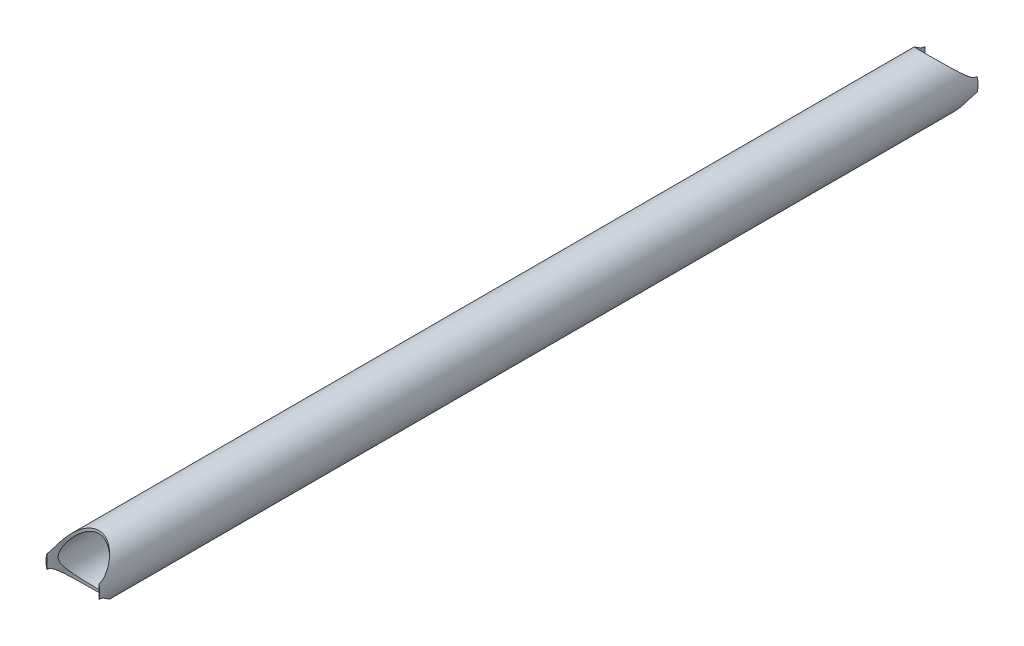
ISO-10303-21;
HEADER;
FILE_DESCRIPTION(('STEP AP214'),'2;1');
FILE_NAME('part.step','',(''),(''),'','','');
FILE_SCHEMA(('AUTOMOTIVE_DESIGN { 1 0 10303 214 1 1 1 1 }'));
ENDSEC;
DATA;
#1=APPLICATION_CONTEXT('core data for automotive mechanical design processes');
#2=APPLICATION_PROTOCOL_DEFINITION('international standard','automotive_design',2000,#1);
#3=PRODUCT_CONTEXT('',#1,'mechanical');
#4=PRODUCT('Part','Part','',(#3));
#5=PRODUCT_RELATED_PRODUCT_CATEGORY('part','',(#4));
#6=PRODUCT_DEFINITION_FORMATION('','',#4);
#7=PRODUCT_DEFINITION_CONTEXT('part definition',#1,'design');
#8=PRODUCT_DEFINITION('design','',#6,#7);
#9=PRODUCT_DEFINITION_SHAPE('','',#8);
#10=(LENGTH_UNIT() NAMED_UNIT(*) SI_UNIT(.MILLI.,.METRE.));
#11=(NAMED_UNIT(*) PLANE_ANGLE_UNIT() SI_UNIT($,.RADIAN.));
#12=(NAMED_UNIT(*) SI_UNIT($,.STERADIAN.) SOLID_ANGLE_UNIT());
#13=UNCERTAINTY_MEASURE_WITH_UNIT(LENGTH_MEASURE(1.E-05),#10,'distance_accuracy_value','');
#14=(GEOMETRIC_REPRESENTATION_CONTEXT(3) GLOBAL_UNCERTAINTY_ASSIGNED_CONTEXT((#13)) GLOBAL_UNIT_ASSIGNED_CONTEXT((#10,
#11,#12)) REPRESENTATION_CONTEXT('',''));
#15=CARTESIAN_POINT('',(0.,0.,0.));
#16=DIRECTION('',(0.,0.,1.));
#17=DIRECTION('',(1.,0.,0.));
#18=AXIS2_PLACEMENT_3D('',#15,#16,#17);
#19=CARTESIAN_POINT('',(0.,0.,0.));
#20=DIRECTION('',(0.,0.,1.));
#21=DIRECTION('',(1.,0.,0.));
#22=AXIS2_PLACEMENT_3D('',#19,#20,#21);
#23=PLANE('',#22);
#24=CARTESIAN_POINT('',(0.,0.,0.));
#25=DIRECTION('',(0.,0.,1.));
#26=DIRECTION('',(1.,0.,0.));
#27=AXIS2_PLACEMENT_3D('',#24,#25,#26);
#28=CIRCLE('',#27,15.);
#29=CARTESIAN_POINT('',(14.5,-3.8405728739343,0.));
#30=VERTEX_POINT('',#29);
#31=CARTESIAN_POINT('',(14.5,3.8405728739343,0.));
#32=VERTEX_POINT('',#31);
#33=EDGE_CURVE('E92',#30,#32,#28,.T.);
#34=ORIENTED_EDGE('',*,*,#33,.F.);
#35=DIRECTION('',(0.,1.,0.));
#36=VECTOR('',#35,1.);
#37=CARTESIAN_POINT('',(14.5,-15.,0.));
#38=LINE('',#37,#36);
#39=EDGE_CURVE('E82',#30,#32,#38,.T.);
#40=ORIENTED_EDGE('',*,*,#39,.T.);
#41=EDGE_LOOP('',(#34,#40));
#42=FACE_BOUND('',#41,.T.);
#43=ADVANCED_FACE('F30',(#42),#23,.F.);
#44=CARTESIAN_POINT('',(0.,0.,490.));
#45=DIRECTION('',(0.,0.,1.));
#46=DIRECTION('',(1.,0.,0.));
#47=AXIS2_PLACEMENT_3D('',#44,#45,#46);
#48=PLANE('',#47);
#49=DIRECTION('',(0.,1.,0.));
#50=VECTOR('',#49,1.);
#51=CARTESIAN_POINT('',(14.5,-15.,490.));
#52=LINE('',#51,#50);
#53=CARTESIAN_POINT('',(14.5,-3.84057287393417,490.));
#54=VERTEX_POINT('',#53);
#55=CARTESIAN_POINT('',(14.5,3.84057287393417,490.));
#56=VERTEX_POINT('',#55);
#57=EDGE_CURVE('E97',#54,#56,#52,.T.);
#58=ORIENTED_EDGE('',*,*,#57,.F.);
#59=CARTESIAN_POINT('',(0.,0.,490.));
#60=DIRECTION('',(0.,0.,1.));
#61=DIRECTION('',(1.,0.,0.));
#62=AXIS2_PLACEMENT_3D('',#59,#60,#61);
#63=CIRCLE('',#62,15.);
#64=EDGE_CURVE('E44',#54,#56,#63,.T.);
#65=ORIENTED_EDGE('',*,*,#64,.T.);
#66=EDGE_LOOP('',(#58,#65));
#67=FACE_BOUND('',#66,.T.);
#68=ADVANCED_FACE('F128',(#67),#48,.T.);
#69=DIRECTION('',(0.,1.,0.));
#70=VECTOR('',#69,1.);
#71=CARTESIAN_POINT('',(-14.5,-15.,490.));
#72=LINE('',#71,#70);
#73=CARTESIAN_POINT('',(-14.5,3.8405728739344,490.));
#74=VERTEX_POINT('',#73);
#75=CARTESIAN_POINT('',(-14.5,-3.8405728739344,490.));
#76=VERTEX_POINT('',#75);
#77=EDGE_CURVE('E119',#74,#76,#72,.F.);
#78=ORIENTED_EDGE('',*,*,#77,.F.);
#79=EDGE_CURVE('E11',#74,#76,#63,.T.);
#80=ORIENTED_EDGE('',*,*,#79,.T.);
#81=EDGE_LOOP('',(#78,#80));
#82=FACE_BOUND('',#81,.T.);
#83=ADVANCED_FACE('F130',(#82),#48,.T.);
#84=CARTESIAN_POINT('',(-14.5,3.8405728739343,0.));
#85=VERTEX_POINT('',#84);
#86=CARTESIAN_POINT('',(-14.5,-3.8405728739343,0.));
#87=VERTEX_POINT('',#86);
#88=EDGE_CURVE('E95',#85,#87,#28,.T.);
#89=ORIENTED_EDGE('',*,*,#88,.F.);
#90=DIRECTION('',(0.,1.,0.));
#91=VECTOR('',#90,1.);
#92=CARTESIAN_POINT('',(-14.5,-15.,0.));
#93=LINE('',#92,#91);
#94=EDGE_CURVE('E85',#85,#87,#93,.F.);
#95=ORIENTED_EDGE('',*,*,#94,.T.);
#96=EDGE_LOOP('',(#89,#95));
#97=FACE_BOUND('',#96,.T.);
#98=ADVANCED_FACE('F132',(#97),#23,.F.);
#99=CARTESIAN_POINT('',(0.,0.,490.));
#100=DIRECTION('',(0.,0.,-1.));
#101=DIRECTION('',(-1.,0.,0.));
#102=AXIS2_PLACEMENT_3D('',#99,#100,#101);
#103=CYLINDRICAL_SURFACE('',#102,15.);
#104=ORIENTED_EDGE('',*,*,#64,.F.);
#105=CARTESIAN_POINT('',(0.,-15.,504.5));
#106=CARTESIAN_POINT('',(0.327741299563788,-14.9999993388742,504.499999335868));
#107=CARTESIAN_POINT('',(0.655491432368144,-14.9892375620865,504.488867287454));
#108=CARTESIAN_POINT('',(1.30809692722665,-14.9464321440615,504.444579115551));
#109=CARTESIAN_POINT('',(1.63295217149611,-14.9143876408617,504.411422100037));
#110=CARTESIAN_POINT('',(2.27718653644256,-14.8297011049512,504.323762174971));
#111=CARTESIAN_POINT('',(2.59656297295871,-14.7770492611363,504.269249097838));
#112=CARTESIAN_POINT('',(3.22727232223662,-14.6522378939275,504.139956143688));
#113=CARTESIAN_POINT('',(3.53860512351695,-14.5800781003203,504.065175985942));
#114=CARTESIAN_POINT('',(4.14921937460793,-14.4181521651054,503.897251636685));
#115=CARTESIAN_POINT('',(4.44856622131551,-14.3285040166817,503.804230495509));
#116=CARTESIAN_POINT('',(5.03579925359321,-14.1328173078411,503.601002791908));
#117=CARTESIAN_POINT('',(5.32368572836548,-14.0267791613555,503.49079666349));
#118=CARTESIAN_POINT('',(5.88691015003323,-13.7998724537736,503.254717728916));
#119=CARTESIAN_POINT('',(6.16224711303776,-13.6790027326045,503.12884369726));
#120=CARTESIAN_POINT('',(6.69963479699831,-13.4239859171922,502.862924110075));
#121=CARTESIAN_POINT('',(6.96168242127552,-13.2898357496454,502.722875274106));
#122=CARTESIAN_POINT('',(7.57634591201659,-12.9524939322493,502.370155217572));
#123=CARTESIAN_POINT('',(7.92219519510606,-12.7434963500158,502.151199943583));
#124=CARTESIAN_POINT('',(8.58603684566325,-12.3060201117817,501.69158250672));
#125=CARTESIAN_POINT('',(8.90401918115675,-12.0775344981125,501.450912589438));
#126=CARTESIAN_POINT('',(9.51292215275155,-11.6040252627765,500.950343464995));
#127=CARTESIAN_POINT('',(9.8037745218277,-11.3589624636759,500.690398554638));
#128=CARTESIAN_POINT('',(10.3579857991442,-10.8559744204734,500.154347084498));
#129=CARTESIAN_POINT('',(10.6213460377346,-10.5980497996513,499.878241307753));
#130=CARTESIAN_POINT('',(11.2084652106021,-9.98046643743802,499.213032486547));
#131=CARTESIAN_POINT('',(11.5212833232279,-9.61668146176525,498.81808618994));
#132=CARTESIAN_POINT('',(12.1002077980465,-8.8772407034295,498.005265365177));
#133=CARTESIAN_POINT('',(12.3662840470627,-8.50157745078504,497.587376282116));
#134=CARTESIAN_POINT('',(12.7311895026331,-7.9351894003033,496.94458747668));
#135=CARTESIAN_POINT('',(12.8470608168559,-7.74603146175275,496.727807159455));
#136=CARTESIAN_POINT('',(13.0676623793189,-7.36777420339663,496.288610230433));
#137=CARTESIAN_POINT('',(13.1723936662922,-7.17867487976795,496.066194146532));
#138=CARTESIAN_POINT('',(13.370754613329,-6.80207186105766,495.615470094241));
#139=CARTESIAN_POINT('',(13.4643925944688,-6.61456706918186,495.387166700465));
#140=CARTESIAN_POINT('',(13.6406852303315,-6.24291154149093,494.923738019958));
#141=CARTESIAN_POINT('',(13.7233421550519,-6.05876011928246,494.688614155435));
#142=CARTESIAN_POINT('',(13.8517563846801,-5.75725687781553,494.290309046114));
#143=CARTESIAN_POINT('',(13.9005986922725,-5.63819418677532,494.129414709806));
#144=CARTESIAN_POINT('',(13.9933190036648,-5.40396844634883,493.803387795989));
#145=CARTESIAN_POINT('',(14.0371969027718,-5.28880547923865,493.63825512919));
#146=CARTESIAN_POINT('',(14.1198472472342,-5.06401368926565,493.302988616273));
#147=CARTESIAN_POINT('',(14.1586198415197,-4.95438470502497,493.132854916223));
#148=CARTESIAN_POINT('',(14.2308039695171,-4.74306937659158,492.78665652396));
#149=CARTESIAN_POINT('',(14.2642168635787,-4.64138102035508,492.610593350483));
#150=CARTESIAN_POINT('',(14.3368431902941,-4.41293897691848,492.1835881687));
#151=CARTESIAN_POINT('',(14.3734945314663,-4.29118840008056,491.929440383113));
#152=CARTESIAN_POINT('',(14.4340822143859,-4.08279040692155,491.405754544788));
#153=CARTESIAN_POINT('',(14.4580590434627,-3.99603142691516,491.136268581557));
#154=CARTESIAN_POINT('',(14.4871539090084,-3.88906664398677,490.64659580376));
#155=CARTESIAN_POINT('',(14.4953069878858,-3.85825931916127,490.42900995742));
#156=CARTESIAN_POINT('',(14.5016403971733,-3.83440226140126,489.991754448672));
#157=CARTESIAN_POINT('',(14.4998330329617,-3.84130593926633,489.772087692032));
#158=CARTESIAN_POINT('',(14.4865229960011,-3.89116877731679,489.338438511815));
#159=CARTESIAN_POINT('',(14.4750632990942,-3.93396811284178,489.12443522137));
#160=CARTESIAN_POINT('',(14.4435698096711,-4.0480528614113,488.704698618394));
#161=CARTESIAN_POINT('',(14.4235170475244,-4.11940127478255,488.498984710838));
#162=CARTESIAN_POINT('',(14.3682364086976,-4.30886221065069,488.031236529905));
#163=CARTESIAN_POINT('',(14.3301919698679,-4.43463727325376,487.772726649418));
#164=CARTESIAN_POINT('',(14.2428190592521,-4.70773885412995,487.269144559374));
#165=CARTESIAN_POINT('',(14.1934667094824,-4.85511073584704,487.024102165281));
#166=CARTESIAN_POINT('',(14.08405679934,-5.16395440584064,486.543039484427));
#167=CARTESIAN_POINT('',(14.0239228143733,-5.32552235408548,486.307099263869));
#168=CARTESIAN_POINT('',(13.8937219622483,-5.65651343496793,485.844008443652));
#169=CARTESIAN_POINT('',(13.8236631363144,-5.82593013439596,485.616850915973));
#170=CARTESIAN_POINT('',(13.6675997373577,-6.18367873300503,485.151094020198));
#171=CARTESIAN_POINT('',(13.5807573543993,-6.37241983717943,484.913091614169));
#172=CARTESIAN_POINT('',(13.3956612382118,-6.75285501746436,484.443936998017));
#173=CARTESIAN_POINT('',(13.2974055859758,-6.9445495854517,484.212785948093));
#174=CARTESIAN_POINT('',(13.0893387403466,-7.32919287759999,483.756431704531));
#175=CARTESIAN_POINT('',(12.9795177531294,-7.52214253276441,483.531233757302));
#176=CARTESIAN_POINT('',(12.748254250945,-7.90775531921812,483.086623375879));
#177=CARTESIAN_POINT('',(12.6268106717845,-8.1004184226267,482.867211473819));
#178=CARTESIAN_POINT('',(12.245727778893,-8.67483037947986,482.219062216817));
#179=CARTESIAN_POINT('',(11.9685283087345,-9.05451857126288,481.798637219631));
#180=CARTESIAN_POINT('',(11.3657163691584,-9.80053446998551,480.981809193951));
#181=CARTESIAN_POINT('',(11.0401387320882,-10.1668715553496,480.585389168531));
#182=CARTESIAN_POINT('',(10.4458209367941,-10.7705796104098,479.936963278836));
#183=CARTESIAN_POINT('',(10.1901014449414,-11.0131605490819,479.677835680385));
#184=CARTESIAN_POINT('',(9.65376776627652,-11.4861917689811,479.174567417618));
#185=CARTESIAN_POINT('',(9.37315361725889,-11.7166420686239,478.930426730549));
#186=CARTESIAN_POINT('',(8.78693757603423,-12.1624510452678,478.459595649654));
#187=CARTESIAN_POINT('',(8.48135835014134,-12.3778230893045,478.232889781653));
#188=CARTESIAN_POINT('',(7.84500128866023,-12.790609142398,477.799424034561));
#189=CARTESIAN_POINT('',(7.51423198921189,-12.9880291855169,477.592657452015));
#190=CARTESIAN_POINT('',(6.90011393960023,-13.3222988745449,477.243211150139));
#191=CARTESIAN_POINT('',(6.62140842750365,-13.4631585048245,477.096195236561));
#192=CARTESIAN_POINT('',(6.04927297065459,-13.7297419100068,476.818294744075));
#193=CARTESIAN_POINT('',(5.75585138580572,-13.8554741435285,476.687401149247));
#194=CARTESIAN_POINT('',(5.1551523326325,-14.0900084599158,476.443471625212));
#195=CARTESIAN_POINT('',(4.84787677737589,-14.1988128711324,476.330433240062));
#196=CARTESIAN_POINT('',(4.22085203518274,-14.3976582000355,476.124001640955));
#197=CARTESIAN_POINT('',(3.90110271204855,-14.4876989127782,476.030608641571));
#198=CARTESIAN_POINT('',(3.24829149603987,-14.647952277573,475.864477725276));
#199=CARTESIAN_POINT('',(2.91513888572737,-14.7179880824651,475.791924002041));
#200=CARTESIAN_POINT('',(2.24068155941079,-14.8356498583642,475.670074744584));
#201=CARTESIAN_POINT('',(1.89937680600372,-14.883275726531,475.620779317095));
#202=CARTESIAN_POINT('',(1.21188122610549,-14.9549560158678,475.546598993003));
#203=CARTESIAN_POINT('',(0.865693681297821,-14.9790255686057,475.521698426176));
#204=CARTESIAN_POINT('',(0.171608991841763,-15.0030357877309,475.496859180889));
#205=CARTESIAN_POINT('',(-0.176287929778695,-15.0029795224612,475.496917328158));
#206=CARTESIAN_POINT('',(-0.823689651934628,-14.9803858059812,475.520291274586));
#207=CARTESIAN_POINT('',(-1.12342183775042,-14.9608670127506,475.540484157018));
#208=CARTESIAN_POINT('',(-1.71936514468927,-14.9041386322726,475.599187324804));
#209=CARTESIAN_POINT('',(-2.0155766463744,-14.8669309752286,475.637695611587));
#210=CARTESIAN_POINT('',(-2.60249660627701,-14.7754946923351,475.732365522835));
#211=CARTESIAN_POINT('',(-2.89320472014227,-14.7212650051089,475.788528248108));
#212=CARTESIAN_POINT('',(-3.46735497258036,-14.5967035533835,475.91759820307));
#213=CARTESIAN_POINT('',(-3.75079673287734,-14.5263709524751,475.990506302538));
#214=CARTESIAN_POINT('',(-4.31193723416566,-14.3698629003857,476.152854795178));
#215=CARTESIAN_POINT('',(-4.58954148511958,-14.283525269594,476.242464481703));
#216=CARTESIAN_POINT('',(-5.1347293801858,-14.0967241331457,476.436507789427));
#217=CARTESIAN_POINT('',(-5.40230915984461,-13.9962552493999,476.540947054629));
#218=CARTESIAN_POINT('',(-5.92643922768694,-13.7825039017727,476.763370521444));
#219=CARTESIAN_POINT('',(-6.18299045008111,-13.6692225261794,476.881353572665));
#220=CARTESIAN_POINT('',(-6.68451567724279,-13.431096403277,477.129662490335));
#221=CARTESIAN_POINT('',(-6.92948718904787,-13.3062491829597,477.259990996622));
#222=CARTESIAN_POINT('',(-7.52798113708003,-12.9806371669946,477.600382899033));
#223=CARTESIAN_POINT('',(-7.87396258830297,-12.7733317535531,477.817518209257));
#224=CARTESIAN_POINT('',(-8.53827355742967,-12.3391851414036,478.273518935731));
#225=CARTESIAN_POINT('',(-8.85659169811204,-12.1123359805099,478.51239321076));
#226=CARTESIAN_POINT('',(-9.46640195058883,-11.641987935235,479.009441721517));
#227=CARTESIAN_POINT('',(-9.75782017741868,-11.3984462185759,479.267665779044));
#228=CARTESIAN_POINT('',(-10.3132964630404,-10.8984207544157,479.800294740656));
#229=CARTESIAN_POINT('',(-10.5773561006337,-10.6419377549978,480.074698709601));
#230=CARTESIAN_POINT('',(-11.1665172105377,-10.0273634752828,480.736205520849));
#231=CARTESIAN_POINT('',(-11.4806924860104,-9.66509293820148,481.129174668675));
#232=CARTESIAN_POINT('',(-12.0624675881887,-8.9284439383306,481.93802833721));
#233=CARTESIAN_POINT('',(-12.3300379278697,-8.55405798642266,482.353927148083));
#234=CARTESIAN_POINT('',(-12.6972877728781,-7.98932272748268,482.99363732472));
#235=CARTESIAN_POINT('',(-12.8139556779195,-7.80067457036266,483.209373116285));
#236=CARTESIAN_POINT('',(-13.036190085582,-7.42331846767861,483.646428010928));
#237=CARTESIAN_POINT('',(-13.1417576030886,-7.23461052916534,483.867746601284));
#238=CARTESIAN_POINT('',(-13.3418375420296,-6.85862147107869,484.316197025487));
#239=CARTESIAN_POINT('',(-13.4363579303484,-6.67133941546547,484.543324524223));
#240=CARTESIAN_POINT('',(-13.6144681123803,-6.29989069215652,485.004268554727));
#241=CARTESIAN_POINT('',(-13.6980600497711,-6.11572341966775,485.238083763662));
#242=CARTESIAN_POINT('',(-13.8288477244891,-5.81211980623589,485.636347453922));
#243=CARTESIAN_POINT('',(-13.879037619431,-5.69111453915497,485.798619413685));
#244=CARTESIAN_POINT('',(-13.9743453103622,-5.45289997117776,486.127406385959));
#245=CARTESIAN_POINT('',(-14.0194630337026,-5.33569072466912,486.293921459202));
#246=CARTESIAN_POINT('',(-14.1044954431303,-5.10667297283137,486.631973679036));
#247=CARTESIAN_POINT('',(-14.1444098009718,-4.99486480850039,486.803511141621));
#248=CARTESIAN_POINT('',(-14.2187819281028,-4.77904714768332,487.152536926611));
#249=CARTESIAN_POINT('',(-14.2532410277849,-4.67503575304,487.330023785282));
#250=CARTESIAN_POINT('',(-14.3284313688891,-4.44030650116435,487.761508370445));
#251=CARTESIAN_POINT('',(-14.3665150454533,-4.3146043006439,488.018789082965));
#252=CARTESIAN_POINT('',(-14.4296894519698,-4.09839787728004,488.549212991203));
#253=CARTESIAN_POINT('',(-14.4548215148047,-4.00778191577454,488.822302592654));
#254=CARTESIAN_POINT('',(-14.4854305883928,-3.89550660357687,489.315897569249));
#255=CARTESIAN_POINT('',(-14.4941540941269,-3.86259471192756,489.533527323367));
#256=CARTESIAN_POINT('',(-14.5016171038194,-3.8344990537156,489.971242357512));
#257=CARTESIAN_POINT('',(-14.5003706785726,-3.83926211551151,490.191323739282));
#258=CARTESIAN_POINT('',(-14.488102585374,-3.88527144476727,490.626244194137));
#259=CARTESIAN_POINT('',(-14.4771189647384,-3.92637571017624,490.841100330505));
#260=CARTESIAN_POINT('',(-14.4464747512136,-4.03765129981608,491.262640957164));
#261=CARTESIAN_POINT('',(-14.4267941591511,-4.10788959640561,491.46930540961));
#262=CARTESIAN_POINT('',(-14.3729809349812,-4.29291455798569,491.933141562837));
#263=CARTESIAN_POINT('',(-14.3362937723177,-4.41473465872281,492.187128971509));
#264=CARTESIAN_POINT('',(-14.2520127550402,-4.67969937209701,492.68203217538));
#265=CARTESIAN_POINT('',(-14.2043962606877,-4.8228880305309,492.922919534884));
#266=CARTESIAN_POINT('',(-14.0988416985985,-5.12330334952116,493.395840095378));
#267=CARTESIAN_POINT('',(-14.0408309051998,-5.28062475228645,493.627795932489));
#268=CARTESIAN_POINT('',(-13.9152482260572,-5.60319992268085,494.083082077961));
#269=CARTESIAN_POINT('',(-13.8476839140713,-5.76844733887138,494.306419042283));
#270=CARTESIAN_POINT('',(-13.6966135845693,-6.11902297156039,494.766183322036));
#271=CARTESIAN_POINT('',(-13.6122178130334,-6.30481402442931,495.001963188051));
#272=CARTESIAN_POINT('',(-13.432310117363,-6.6795422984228,495.466728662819));
#273=CARTESIAN_POINT('',(-13.3367962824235,-6.86848005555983,495.695713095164));
#274=CARTESIAN_POINT('',(-13.134525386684,-7.24779173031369,496.147813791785));
#275=CARTESIAN_POINT('',(-13.0277588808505,-7.43816672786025,496.370924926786));
#276=CARTESIAN_POINT('',(-12.8029270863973,-7.81882060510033,496.811474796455));
#277=CARTESIAN_POINT('',(-12.6848607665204,-8.00909947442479,497.028913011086));
#278=CARTESIAN_POINT('',(-12.3143443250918,-8.57674330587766,497.671444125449));
#279=CARTESIAN_POINT('',(-12.0448269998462,-8.95234295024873,498.088430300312));
#280=CARTESIAN_POINT('',(-11.4587824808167,-9.69116372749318,498.899222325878));
#281=CARTESIAN_POINT('',(-11.1422875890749,-10.05439315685,499.293043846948));
#282=CARTESIAN_POINT('',(-10.5586918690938,-10.6600350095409,499.944659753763));
#283=CARTESIAN_POINT('',(-10.3036391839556,-10.9071002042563,500.208949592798));
#284=CARTESIAN_POINT('',(-9.76811705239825,-11.3891910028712,500.7224765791));
#285=CARTESIAN_POINT('',(-9.48764728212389,-11.6242164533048,500.971713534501));
#286=CARTESIAN_POINT('',(-8.90114123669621,-12.0792106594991,501.45265840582));
#287=CARTESIAN_POINT('',(-8.59512708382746,-12.2991921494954,501.684381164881));
#288=CARTESIAN_POINT('',(-7.95727869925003,-12.721156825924,502.127755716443));
#289=CARTESIAN_POINT('',(-7.62545336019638,-12.9231461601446,502.339414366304));
#290=CARTESIAN_POINT('',(-7.01044581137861,-13.2645916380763,502.696515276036));
#291=CARTESIAN_POINT('',(-6.73212693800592,-13.4081598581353,502.846414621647));
#292=CARTESIAN_POINT('',(-6.16049260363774,-13.6802207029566,503.130120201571));
#293=CARTESIAN_POINT('',(-5.86718571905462,-13.8087218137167,503.263935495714));
#294=CARTESIAN_POINT('',(-5.26652112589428,-14.0487829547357,503.513677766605));
#295=CARTESIAN_POINT('',(-4.9591706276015,-14.1603515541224,503.629613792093));
#296=CARTESIAN_POINT('',(-4.33167712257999,-14.3647277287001,503.841828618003));
#297=CARTESIAN_POINT('',(-4.01153520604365,-14.4575368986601,503.938109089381));
#298=CARTESIAN_POINT('',(-3.39125534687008,-14.6147815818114,504.101143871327));
#299=CARTESIAN_POINT('',(-3.09209600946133,-14.6810722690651,504.169831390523));
#300=CARTESIAN_POINT('',(-2.48669637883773,-14.795648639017,504.288507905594));
#301=CARTESIAN_POINT('',(-2.18045667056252,-14.8439358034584,504.338498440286));
#302=CARTESIAN_POINT('',(-1.5631248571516,-14.9215743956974,504.418858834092));
#303=CARTESIAN_POINT('',(-1.25203433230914,-14.9509318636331,504.44923495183));
#304=CARTESIAN_POINT('',(-0.627298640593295,-14.9901453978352,504.489806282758));
#305=CARTESIAN_POINT('',(-0.313653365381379,-15.0000006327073,504.500000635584));
#306=CARTESIAN_POINT('',(0.,-15.,504.5));
#307=B_SPLINE_CURVE_WITH_KNOTS('',3,(#105,#106,#107,#108,#109,#110,#111,#112,#113,#114,#115,
#116,#117,#118,#119,#120,#121,#122,#123,#124,#125,#126,#127,#128,#129,#130,#131,#132,#133,#134,
#135,#136,#137,#138,#139,#140,#141,#142,#143,#144,#145,#146,#147,#148,#149,#150,#151,#152,#153,
#154,#155,#156,#157,#158,#159,#160,#161,#162,#163,#164,#165,#166,#167,#168,#169,#170,#171,#172,
#173,#174,#175,#176,#177,#178,#179,#180,#181,#182,#183,#184,#185,#186,#187,#188,#189,#190,#191,
#192,#193,#194,#195,#196,#197,#198,#199,#200,#201,#202,#203,#204,#205,#206,#207,#208,#209,#210,
#211,#212,#213,#214,#215,#216,#217,#218,#219,#220,#221,#222,#223,#224,#225,#226,#227,#228,#229,
#230,#231,#232,#233,#234,#235,#236,#237,#238,#239,#240,#241,#242,#243,#244,#245,#246,#247,#248,
#249,#250,#251,#252,#253,#254,#255,#256,#257,#258,#259,#260,#261,#262,#263,#264,#265,#266,#267,
#268,#269,#270,#271,#272,#273,#274,#275,#276,#277,#278,#279,#280,#281,#282,#283,#284,#285,#286,
#287,#288,#289,#290,#291,#292,#293,#294,#295,#296,#297,#298,#299,#300,#301,#302,#303,#304,#305,
#306),.UNSPECIFIED.,.T.,.F.,(4,2,2,2,2,2,2,2,2,2,2,2,2,2,2,2,2,2,2,2,2,2,2,2,2,2,2,2,2,2,2,2,2,
2,2,2,2,2,2,2,2,2,2,2,2,2,2,2,2,2,2,2,2,2,2,2,2,2,2,2,2,2,2,2,2,2,2,2,2,2,2,2,2,2,2,2,2,2,2,2,2,
2,2,2,2,2,2,2,2,2,2,2,2,2,2,2,2,2,2,2,4),(0.,0.982877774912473,1.96579535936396,
2.94918147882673,3.93258122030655,4.90956218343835,5.88651847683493,6.86355123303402,
7.84081062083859,9.21755904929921,10.5948010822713,11.9754201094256,13.3559722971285,
15.2176925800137,17.0806079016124,18.0108922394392,18.9410897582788,19.8705850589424,
20.7998879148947,21.4178644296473,22.0358539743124,22.6538254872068,23.2716399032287,
24.1223688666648,24.9703635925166,25.6269654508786,26.2827563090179,26.9356426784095,
27.5899778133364,28.4578142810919,29.3275004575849,30.2036143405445,31.0790224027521,
32.0264772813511,32.9740916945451,33.9225151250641,34.8710254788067,36.7606589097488,
38.6489383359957,39.9603713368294,41.2718023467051,42.5820556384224,43.8918668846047,
44.9264085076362,45.9603689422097,46.9941870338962,48.0280164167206,49.0707205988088,
50.1134295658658,51.1554683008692,52.1973745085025,53.0994258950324,54.0013788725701,
54.9033881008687,55.8054441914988,56.7171971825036,57.6292981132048,58.5413216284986,
59.4535406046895,60.825675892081,62.1983728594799,63.5747344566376,64.951016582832,
66.808369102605,68.6668925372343,69.5949549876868,70.5229325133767,71.4502366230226,
72.3773585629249,73.0028970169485,73.6284444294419,74.2540312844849,74.8794653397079,
75.744285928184,76.6063292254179,77.2640804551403,77.9209035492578,78.575171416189,
79.2309517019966,80.0810921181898,80.9330097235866,81.7911388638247,82.6485914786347,
83.5837357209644,84.5190409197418,85.455137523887,86.3913196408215,88.2567257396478,
90.1208550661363,91.4478027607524,92.7747673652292,94.1005944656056,95.425966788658,
96.4666240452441,97.5066923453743,98.5462325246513,99.5856842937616,100.52665087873,
101.467540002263,102.408128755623,103.348757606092),.UNSPECIFIED.);
#308=EDGE_CURVE('E59',#54,#76,#307,.T.);
#309=ORIENTED_EDGE('',*,*,#308,.T.);
#310=ORIENTED_EDGE('',*,*,#79,.F.);
#311=CARTESIAN_POINT('',(0.,15.,504.5));
#312=CARTESIAN_POINT('',(-0.327741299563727,14.9999993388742,504.499999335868));
#313=CARTESIAN_POINT('',(-0.655491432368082,14.9892375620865,504.488867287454));
#314=CARTESIAN_POINT('',(-1.30809692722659,14.9464321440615,504.444579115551));
#315=CARTESIAN_POINT('',(-1.63295217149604,14.9143876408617,504.411422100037));
#316=CARTESIAN_POINT('',(-2.27718653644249,14.8297011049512,504.323762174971));
#317=CARTESIAN_POINT('',(-2.59656297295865,14.7770492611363,504.269249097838));
#318=CARTESIAN_POINT('',(-3.22727232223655,14.6522378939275,504.139956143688));
#319=CARTESIAN_POINT('',(-3.53860512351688,14.5800781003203,504.065175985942));
#320=CARTESIAN_POINT('',(-4.14921937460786,14.4181521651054,503.897251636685));
#321=CARTESIAN_POINT('',(-4.44856622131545,14.3285040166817,503.804230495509));
#322=CARTESIAN_POINT('',(-5.03579925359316,14.1328173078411,503.601002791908));
#323=CARTESIAN_POINT('',(-5.32368572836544,14.0267791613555,503.49079666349));
#324=CARTESIAN_POINT('',(-5.88691015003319,13.7998724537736,503.254717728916));
#325=CARTESIAN_POINT('',(-6.16224711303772,13.6790027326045,503.12884369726));
#326=CARTESIAN_POINT('',(-6.69963479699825,13.4239859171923,502.862924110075));
#327=CARTESIAN_POINT('',(-6.96168242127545,13.2898357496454,502.722875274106));
#328=CARTESIAN_POINT('',(-7.57634591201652,12.9524939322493,502.370155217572));
#329=CARTESIAN_POINT('',(-7.92219519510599,12.7434963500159,502.151199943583));
#330=CARTESIAN_POINT('',(-8.58603684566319,12.3060201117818,501.69158250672));
#331=CARTESIAN_POINT('',(-8.90401918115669,12.0775344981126,501.450912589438));
#332=CARTESIAN_POINT('',(-9.51292215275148,11.6040252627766,500.950343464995));
#333=CARTESIAN_POINT('',(-9.80377452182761,11.358962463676,500.690398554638));
#334=CARTESIAN_POINT('',(-10.3579857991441,10.8559744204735,500.154347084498));
#335=CARTESIAN_POINT('',(-10.6213460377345,10.5980497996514,499.878241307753));
#336=CARTESIAN_POINT('',(-11.208465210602,9.98046643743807,499.213032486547));
#337=CARTESIAN_POINT('',(-11.5212833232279,9.61668146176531,498.81808618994));
#338=CARTESIAN_POINT('',(-12.1002077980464,8.87724070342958,498.005265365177));
#339=CARTESIAN_POINT('',(-12.3662840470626,8.50157745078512,497.587376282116));
#340=CARTESIAN_POINT('',(-12.731189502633,7.93518940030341,496.94458747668));
#341=CARTESIAN_POINT('',(-12.8470608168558,7.74603146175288,496.727807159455));
#342=CARTESIAN_POINT('',(-13.0676623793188,7.36777420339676,496.288610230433));
#343=CARTESIAN_POINT('',(-13.1723936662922,7.17867487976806,496.066194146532));
#344=CARTESIAN_POINT('',(-13.3707546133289,6.80207186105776,495.615470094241));
#345=CARTESIAN_POINT('',(-13.4643925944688,6.61456706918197,495.387166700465));
#346=CARTESIAN_POINT('',(-13.6406852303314,6.24291154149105,494.923738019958));
#347=CARTESIAN_POINT('',(-13.7233421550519,6.0587601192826,494.688614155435));
#348=CARTESIAN_POINT('',(-13.8517563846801,5.75725687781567,494.290309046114));
#349=CARTESIAN_POINT('',(-13.9005986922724,5.63819418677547,494.129414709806));
#350=CARTESIAN_POINT('',(-13.9933190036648,5.403968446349,493.803387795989));
#351=CARTESIAN_POINT('',(-14.0371969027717,5.28880547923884,493.63825512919));
#352=CARTESIAN_POINT('',(-14.1198472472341,5.06401368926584,493.302988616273));
#353=CARTESIAN_POINT('',(-14.1586198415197,4.95438470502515,493.132854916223));
#354=CARTESIAN_POINT('',(-14.230803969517,4.74306937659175,492.78665652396));
#355=CARTESIAN_POINT('',(-14.2642168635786,4.64138102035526,492.610593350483));
#356=CARTESIAN_POINT('',(-14.336843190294,4.41293897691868,492.1835881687));
#357=CARTESIAN_POINT('',(-14.3734945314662,4.29118840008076,491.929440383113));
#358=CARTESIAN_POINT('',(-14.4340822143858,4.08279040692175,491.405754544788));
#359=CARTESIAN_POINT('',(-14.4580590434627,3.99603142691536,491.136268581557));
#360=CARTESIAN_POINT('',(-14.4871539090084,3.88906664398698,490.64659580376));
#361=CARTESIAN_POINT('',(-14.4953069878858,3.85825931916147,490.42900995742));
#362=CARTESIAN_POINT('',(-14.5016403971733,3.83440226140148,489.991754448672));
#363=CARTESIAN_POINT('',(-14.4998330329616,3.84130593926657,489.772087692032));
#364=CARTESIAN_POINT('',(-14.486522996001,3.89116877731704,489.338438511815));
#365=CARTESIAN_POINT('',(-14.4750632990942,3.93396811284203,489.12443522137));
#366=CARTESIAN_POINT('',(-14.443569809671,4.04805286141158,488.704698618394));
#367=CARTESIAN_POINT('',(-14.4235170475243,4.11940127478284,488.498984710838));
#368=CARTESIAN_POINT('',(-14.3682364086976,4.30886221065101,488.031236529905));
#369=CARTESIAN_POINT('',(-14.3301919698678,4.4346372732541,487.772726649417));
#370=CARTESIAN_POINT('',(-14.242819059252,4.70773885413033,487.269144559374));
#371=CARTESIAN_POINT('',(-14.1934667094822,4.85511073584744,487.02410216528));
#372=CARTESIAN_POINT('',(-14.0840567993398,5.16395440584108,486.543039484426));
#373=CARTESIAN_POINT('',(-14.0239228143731,5.32552235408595,486.307099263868));
#374=CARTESIAN_POINT('',(-13.8937219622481,5.65651343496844,485.844008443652));
#375=CARTESIAN_POINT('',(-13.8236631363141,5.8259301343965,485.616850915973));
#376=CARTESIAN_POINT('',(-13.6675997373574,6.1836787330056,485.151094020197));
#377=CARTESIAN_POINT('',(-13.580757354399,6.37241983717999,484.913091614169));
#378=CARTESIAN_POINT('',(-13.3956612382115,6.75285501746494,484.443936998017));
#379=CARTESIAN_POINT('',(-13.2974055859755,6.94454958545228,484.212785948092));
#380=CARTESIAN_POINT('',(-13.0893387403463,7.32919287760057,483.75643170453));
#381=CARTESIAN_POINT('',(-12.9795177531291,7.52214253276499,483.531233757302));
#382=CARTESIAN_POINT('',(-12.7482542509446,7.9077553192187,483.086623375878));
#383=CARTESIAN_POINT('',(-12.6268106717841,8.10041842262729,482.867211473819));
#384=CARTESIAN_POINT('',(-12.2457277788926,8.67483037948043,482.219062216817));
#385=CARTESIAN_POINT('',(-11.9685283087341,9.05451857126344,481.79863721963));
#386=CARTESIAN_POINT('',(-11.365716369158,9.80053446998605,480.98180919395));
#387=CARTESIAN_POINT('',(-11.0401387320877,10.1668715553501,480.585389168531));
#388=CARTESIAN_POINT('',(-10.4458209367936,10.7705796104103,479.936963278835));
#389=CARTESIAN_POINT('',(-10.1901014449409,11.0131605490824,479.677835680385));
#390=CARTESIAN_POINT('',(-9.65376776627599,11.4861917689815,479.174567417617));
#391=CARTESIAN_POINT('',(-9.37315361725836,11.7166420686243,478.930426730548));
#392=CARTESIAN_POINT('',(-8.78693757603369,12.1624510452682,478.459595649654));
#393=CARTESIAN_POINT('',(-8.48135835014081,12.3778230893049,478.232889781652));
#394=CARTESIAN_POINT('',(-7.84500128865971,12.7906091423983,477.799424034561));
#395=CARTESIAN_POINT('',(-7.51423198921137,12.9880291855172,477.592657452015));
#396=CARTESIAN_POINT('',(-6.90011393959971,13.3222988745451,477.243211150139));
#397=CARTESIAN_POINT('',(-6.62140842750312,13.4631585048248,477.096195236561));
#398=CARTESIAN_POINT('',(-6.04927297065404,13.729741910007,476.818294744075));
#399=CARTESIAN_POINT('',(-5.75585138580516,13.8554741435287,476.687401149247));
#400=CARTESIAN_POINT('',(-5.15515233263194,14.090008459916,476.443471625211));
#401=CARTESIAN_POINT('',(-4.84787677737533,14.1988128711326,476.330433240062));
#402=CARTESIAN_POINT('',(-4.2208520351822,14.3976582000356,476.124001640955));
#403=CARTESIAN_POINT('',(-3.90110271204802,14.4876989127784,476.030608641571));
#404=CARTESIAN_POINT('',(-3.24829149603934,14.6479522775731,475.864477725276));
#405=CARTESIAN_POINT('',(-2.91513888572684,14.7179880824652,475.791924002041));
#406=CARTESIAN_POINT('',(-2.24068155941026,14.8356498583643,475.670074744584));
#407=CARTESIAN_POINT('',(-1.8993768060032,14.8832757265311,475.620779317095));
#408=CARTESIAN_POINT('',(-1.21188122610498,14.9549560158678,475.546598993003));
#409=CARTESIAN_POINT('',(-0.865693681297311,14.9790255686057,475.521698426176));
#410=CARTESIAN_POINT('',(-0.171608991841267,15.0030357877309,475.496859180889));
#411=CARTESIAN_POINT('',(0.176287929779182,15.0029795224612,475.496917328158));
#412=CARTESIAN_POINT('',(0.823689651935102,14.9803858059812,475.520291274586));
#413=CARTESIAN_POINT('',(1.12342183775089,14.9608670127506,475.540484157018));
#414=CARTESIAN_POINT('',(1.71936514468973,14.9041386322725,475.599187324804));
#415=CARTESIAN_POINT('',(2.01557664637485,14.8669309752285,475.637695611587));
#416=CARTESIAN_POINT('',(2.60249660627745,14.775494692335,475.732365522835));
#417=CARTESIAN_POINT('',(2.89320472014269,14.7212650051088,475.788528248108));
#418=CARTESIAN_POINT('',(3.46735497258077,14.5967035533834,475.91759820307));
#419=CARTESIAN_POINT('',(3.75079673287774,14.526370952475,475.990506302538));
#420=CARTESIAN_POINT('',(4.31193723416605,14.3698629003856,476.152854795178));
#421=CARTESIAN_POINT('',(4.58954148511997,14.2835252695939,476.242464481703));
#422=CARTESIAN_POINT('',(5.13472938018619,14.0967241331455,476.436507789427));
#423=CARTESIAN_POINT('',(5.402309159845,13.9962552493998,476.540947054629));
#424=CARTESIAN_POINT('',(5.92643922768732,13.7825039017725,476.763370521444));
#425=CARTESIAN_POINT('',(6.18299045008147,13.6692225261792,476.881353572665));
#426=CARTESIAN_POINT('',(6.68451567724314,13.4310964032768,477.129662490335));
#427=CARTESIAN_POINT('',(6.92948718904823,13.3062491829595,477.259990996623));
#428=CARTESIAN_POINT('',(7.5279811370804,12.9806371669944,477.600382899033));
#429=CARTESIAN_POINT('',(7.87396258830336,12.7733317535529,477.817518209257));
#430=CARTESIAN_POINT('',(8.53827355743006,12.3391851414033,478.273518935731));
#431=CARTESIAN_POINT('',(8.85659169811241,12.1123359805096,478.51239321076));
#432=CARTESIAN_POINT('',(9.46640195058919,11.6419879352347,479.009441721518));
#433=CARTESIAN_POINT('',(9.75782017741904,11.3984462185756,479.267665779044));
#434=CARTESIAN_POINT('',(10.3132964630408,10.8984207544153,479.800294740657));
#435=CARTESIAN_POINT('',(10.5773561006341,10.6419377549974,480.074698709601));
#436=CARTESIAN_POINT('',(11.166517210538,10.0273634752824,480.736205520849));
#437=CARTESIAN_POINT('',(11.4806924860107,9.66509293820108,481.129174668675));
#438=CARTESIAN_POINT('',(12.062467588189,8.92844393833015,481.93802833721));
#439=CARTESIAN_POINT('',(12.33003792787,8.55405798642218,482.353927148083));
#440=CARTESIAN_POINT('',(12.6972877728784,7.98932272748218,482.993637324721));
#441=CARTESIAN_POINT('',(12.8139556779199,7.80067457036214,483.209373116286));
#442=CARTESIAN_POINT('',(13.0361900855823,7.42331846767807,483.646428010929));
#443=CARTESIAN_POINT('',(13.1417576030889,7.2346105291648,483.867746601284));
#444=CARTESIAN_POINT('',(13.3418375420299,6.85862147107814,484.316197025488));
#445=CARTESIAN_POINT('',(13.4363579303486,6.67133941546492,484.543324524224));
#446=CARTESIAN_POINT('',(13.6144681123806,6.29989069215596,485.004268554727));
#447=CARTESIAN_POINT('',(13.6980600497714,6.11572341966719,485.238083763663));
#448=CARTESIAN_POINT('',(13.8288477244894,5.81211980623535,485.636347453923));
#449=CARTESIAN_POINT('',(13.8790376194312,5.69111453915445,485.798619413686));
#450=CARTESIAN_POINT('',(13.9743453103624,5.45289997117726,486.127406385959));
#451=CARTESIAN_POINT('',(14.0194630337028,5.33569072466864,486.293921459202));
#452=CARTESIAN_POINT('',(14.1044954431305,5.10667297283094,486.631973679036));
#453=CARTESIAN_POINT('',(14.1444098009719,4.99486480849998,486.803511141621));
#454=CARTESIAN_POINT('',(14.2187819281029,4.77904714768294,487.152536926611));
#455=CARTESIAN_POINT('',(14.253241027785,4.67503575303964,487.330023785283));
#456=CARTESIAN_POINT('',(14.3284313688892,4.44030650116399,487.761508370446));
#457=CARTESIAN_POINT('',(14.3665150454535,4.31460430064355,488.018789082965));
#458=CARTESIAN_POINT('',(14.4296894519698,4.09839787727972,488.549212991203));
#459=CARTESIAN_POINT('',(14.4548215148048,4.00778191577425,488.822302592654));
#460=CARTESIAN_POINT('',(14.4854305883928,3.89550660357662,489.315897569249));
#461=CARTESIAN_POINT('',(14.4941540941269,3.86259471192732,489.533527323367));
#462=CARTESIAN_POINT('',(14.5016171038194,3.83449905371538,489.971242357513));
#463=CARTESIAN_POINT('',(14.5003706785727,3.83926211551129,490.191323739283));
#464=CARTESIAN_POINT('',(14.488102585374,3.88527144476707,490.626244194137));
#465=CARTESIAN_POINT('',(14.4771189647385,3.92637571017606,490.841100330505));
#466=CARTESIAN_POINT('',(14.4464747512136,4.0376512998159,491.262640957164));
#467=CARTESIAN_POINT('',(14.4267941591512,4.10788959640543,491.46930540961));
#468=CARTESIAN_POINT('',(14.3729809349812,4.29291455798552,491.933141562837));
#469=CARTESIAN_POINT('',(14.3362937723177,4.41473465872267,492.187128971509));
#470=CARTESIAN_POINT('',(14.2520127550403,4.6796993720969,492.68203217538));
#471=CARTESIAN_POINT('',(14.2043962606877,4.82288803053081,492.922919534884));
#472=CARTESIAN_POINT('',(14.0988416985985,5.1233033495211,493.395840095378));
#473=CARTESIAN_POINT('',(14.0408309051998,5.2806247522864,493.627795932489));
#474=CARTESIAN_POINT('',(13.9152482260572,5.60319992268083,494.083082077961));
#475=CARTESIAN_POINT('',(13.8476839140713,5.76844733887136,494.306419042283));
#476=CARTESIAN_POINT('',(13.6966135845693,6.1190229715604,494.766183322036));
#477=CARTESIAN_POINT('',(13.6122178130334,6.30481402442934,495.001963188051));
#478=CARTESIAN_POINT('',(13.432310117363,6.67954229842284,495.466728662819));
#479=CARTESIAN_POINT('',(13.3367962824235,6.86848005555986,495.695713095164));
#480=CARTESIAN_POINT('',(13.134525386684,7.24779173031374,496.147813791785));
#481=CARTESIAN_POINT('',(13.0277588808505,7.43816672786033,496.370924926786));
#482=CARTESIAN_POINT('',(12.8029270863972,7.81882060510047,496.811474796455));
#483=CARTESIAN_POINT('',(12.6848607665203,8.00909947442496,497.028913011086));
#484=CARTESIAN_POINT('',(12.3143443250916,8.57674330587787,497.67144412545));
#485=CARTESIAN_POINT('',(12.044826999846,8.95234295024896,498.088430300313));
#486=CARTESIAN_POINT('',(11.4587824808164,9.69116372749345,498.899222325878));
#487=CARTESIAN_POINT('',(11.1422875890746,10.0543931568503,499.293043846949));
#488=CARTESIAN_POINT('',(10.5586918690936,10.6600350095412,499.944659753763));
#489=CARTESIAN_POINT('',(10.3036391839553,10.9071002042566,500.208949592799));
#490=CARTESIAN_POINT('',(9.76811705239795,11.3891910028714,500.722476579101));
#491=CARTESIAN_POINT('',(9.48764728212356,11.6242164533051,500.971713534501));
#492=CARTESIAN_POINT('',(8.90114123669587,12.0792106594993,501.45265840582));
#493=CARTESIAN_POINT('',(8.59512708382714,12.2991921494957,501.684381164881));
#494=CARTESIAN_POINT('',(7.95727869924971,12.7211568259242,502.127755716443));
#495=CARTESIAN_POINT('',(7.62545336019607,12.9231461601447,502.339414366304));
#496=CARTESIAN_POINT('',(7.01044581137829,13.2645916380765,502.696515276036));
#497=CARTESIAN_POINT('',(6.73212693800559,13.4081598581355,502.846414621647));
#498=CARTESIAN_POINT('',(6.16049260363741,13.6802207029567,503.130120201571));
#499=CARTESIAN_POINT('',(5.86718571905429,13.8087218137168,503.263935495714));
#500=CARTESIAN_POINT('',(5.26652112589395,14.0487829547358,503.513677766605));
#501=CARTESIAN_POINT('',(4.95917062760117,14.1603515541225,503.629613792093));
#502=CARTESIAN_POINT('',(4.33167712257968,14.3647277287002,503.841828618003));
#503=CARTESIAN_POINT('',(4.01153520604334,14.4575368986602,503.938109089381));
#504=CARTESIAN_POINT('',(3.3912553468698,14.6147815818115,504.101143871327));
#505=CARTESIAN_POINT('',(3.09209600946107,14.6810722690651,504.169831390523));
#506=CARTESIAN_POINT('',(2.48669637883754,14.795648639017,504.288507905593));
#507=CARTESIAN_POINT('',(2.18045667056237,14.8439358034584,504.338498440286));
#508=CARTESIAN_POINT('',(1.56312485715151,14.9215743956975,504.418858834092));
#509=CARTESIAN_POINT('',(1.25203433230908,14.9509318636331,504.44923495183));
#510=CARTESIAN_POINT('',(0.627298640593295,14.9901453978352,504.489806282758));
#511=CARTESIAN_POINT('',(0.313653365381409,15.0000006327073,504.500000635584));
#512=CARTESIAN_POINT('',(0.,15.,504.5));
#513=B_SPLINE_CURVE_WITH_KNOTS('',3,(#311,#312,#313,#314,#315,#316,#317,#318,#319,#320,#321,
#322,#323,#324,#325,#326,#327,#328,#329,#330,#331,#332,#333,#334,#335,#336,#337,#338,#339,#340,
#341,#342,#343,#344,#345,#346,#347,#348,#349,#350,#351,#352,#353,#354,#355,#356,#357,#358,#359,
#360,#361,#362,#363,#364,#365,#366,#367,#368,#369,#370,#371,#372,#373,#374,#375,#376,#377,#378,
#379,#380,#381,#382,#383,#384,#385,#386,#387,#388,#389,#390,#391,#392,#393,#394,#395,#396,#397,
#398,#399,#400,#401,#402,#403,#404,#405,#406,#407,#408,#409,#410,#411,#412,#413,#414,#415,#416,
#417,#418,#419,#420,#421,#422,#423,#424,#425,#426,#427,#428,#429,#430,#431,#432,#433,#434,#435,
#436,#437,#438,#439,#440,#441,#442,#443,#444,#445,#446,#447,#448,#449,#450,#451,#452,#453,#454,
#455,#456,#457,#458,#459,#460,#461,#462,#463,#464,#465,#466,#467,#468,#469,#470,#471,#472,#473,
#474,#475,#476,#477,#478,#479,#480,#481,#482,#483,#484,#485,#486,#487,#488,#489,#490,#491,#492,
#493,#494,#495,#496,#497,#498,#499,#500,#501,#502,#503,#504,#505,#506,#507,#508,#509,#510,#511,
#512),.UNSPECIFIED.,.T.,.F.,(4,2,2,2,2,2,2,2,2,2,2,2,2,2,2,2,2,2,2,2,2,2,2,2,2,2,2,2,2,2,2,2,2,
2,2,2,2,2,2,2,2,2,2,2,2,2,2,2,2,2,2,2,2,2,2,2,2,2,2,2,2,2,2,2,2,2,2,2,2,2,2,2,2,2,2,2,2,2,2,2,2,
2,2,2,2,2,2,2,2,2,2,2,2,2,2,2,2,2,2,2,4),(0.,0.982877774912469,1.96579535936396,
2.94918147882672,3.93258122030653,4.90956218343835,5.88651847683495,6.86355123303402,
7.84081062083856,9.21755904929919,10.5948010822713,11.9754201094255,13.3559722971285,
15.2176925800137,17.0806079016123,18.0108922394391,18.9410897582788,19.8705850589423,
20.7998879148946,21.4178644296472,22.0358539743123,22.6538254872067,23.2716399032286,
24.1223688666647,24.9703635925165,25.6269654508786,26.2827563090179,26.9356426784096,
27.5899778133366,28.4578142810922,29.3275004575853,30.2036143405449,31.0790224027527,
32.0264772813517,32.9740916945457,33.9225151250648,34.8710254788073,36.7606589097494,
38.6489383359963,39.96037133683,41.2718023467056,42.5820556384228,43.8918668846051,
44.9264085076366,45.9603689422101,46.9941870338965,48.0280164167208,49.0707205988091,
50.113429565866,51.1554683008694,52.1973745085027,53.0994258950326,54.0013788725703,
54.9033881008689,55.805444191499,56.7171971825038,57.629298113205,58.5413216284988,
59.4535406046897,60.8256758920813,62.1983728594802,63.5747344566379,64.9510165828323,
66.8083691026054,68.6668925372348,69.5949549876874,70.5229325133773,71.4502366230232,
72.3773585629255,73.002897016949,73.6284444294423,74.2540312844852,74.8794653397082,
75.7442859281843,76.6063292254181,77.2640804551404,77.9209035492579,78.5751714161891,
79.2309517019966,80.0810921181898,80.9330097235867,81.7911388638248,82.6485914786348,
83.5837357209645,84.519040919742,85.4551375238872,86.3913196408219,88.2567257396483,
90.1208550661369,91.4478027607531,92.7747673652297,94.1005944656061,95.4259667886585,
96.4666240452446,97.5066923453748,98.5462325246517,99.585684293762,100.52665087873,
101.467540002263,102.408128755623,103.348757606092),.UNSPECIFIED.);
#514=EDGE_CURVE('E52',#74,#56,#513,.T.);
#515=ORIENTED_EDGE('',*,*,#514,.T.);
#516=EDGE_LOOP('',(#104,#309,#310,#515));
#517=FACE_BOUND('',#516,.T.);
#518=CARTESIAN_POINT('',(0.,-15.,14.5));
#519=CARTESIAN_POINT('',(0.327741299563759,-14.9999993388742,14.4999993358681));
#520=CARTESIAN_POINT('',(0.655491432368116,-14.9892375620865,14.4888672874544));
#521=CARTESIAN_POINT('',(1.30809692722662,-14.9464321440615,14.4445791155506));
#522=CARTESIAN_POINT('',(1.63295217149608,-14.9143876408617,14.4114221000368));
#523=CARTESIAN_POINT('',(2.27718653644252,-14.8297011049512,14.3237621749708));
#524=CARTESIAN_POINT('',(2.59656297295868,-14.7770492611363,14.2692490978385));
#525=CARTESIAN_POINT('',(3.22727232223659,-14.6522378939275,14.1399561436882));
#526=CARTESIAN_POINT('',(3.53860512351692,-14.5800781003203,14.065175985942));
#527=CARTESIAN_POINT('',(4.1492193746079,-14.4181521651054,13.8972516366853));
#528=CARTESIAN_POINT('',(4.44856622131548,-14.3285040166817,13.8042304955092));
#529=CARTESIAN_POINT('',(5.03579925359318,-14.1328173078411,13.6010027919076));
#530=CARTESIAN_POINT('',(5.32368572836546,-14.0267791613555,13.4907966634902));
#531=CARTESIAN_POINT('',(5.88691015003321,-13.7998724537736,13.2547177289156));
#532=CARTESIAN_POINT('',(6.16224711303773,-13.6790027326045,13.1288436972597));
#533=CARTESIAN_POINT('',(6.69963479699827,-13.4239859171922,12.8629241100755));
#534=CARTESIAN_POINT('',(6.96168242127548,-13.2898357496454,12.7228752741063));
#535=CARTESIAN_POINT('',(7.57634591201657,-12.9524939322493,12.3701552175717));
#536=CARTESIAN_POINT('',(7.92219519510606,-12.7434963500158,12.1511999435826));
#537=CARTESIAN_POINT('',(8.58603684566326,-12.3060201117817,11.69158250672));
#538=CARTESIAN_POINT('',(8.90401918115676,-12.0775344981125,11.4509125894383));
#539=CARTESIAN_POINT('',(9.51292215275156,-11.6040252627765,10.9503434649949));
#540=CARTESIAN_POINT('',(9.80377452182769,-11.3589624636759,10.6903985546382));
#541=CARTESIAN_POINT('',(10.3579857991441,-10.8559744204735,10.1543470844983));
#542=CARTESIAN_POINT('',(10.6213460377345,-10.5980497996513,9.87824130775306));
#543=CARTESIAN_POINT('',(11.2084652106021,-9.98046643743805,9.21303248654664));
#544=CARTESIAN_POINT('',(11.5212833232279,-9.61668146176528,8.81808618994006));
#545=CARTESIAN_POINT('',(12.1002077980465,-8.87724070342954,8.0052653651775));
#546=CARTESIAN_POINT('',(12.3662840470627,-8.50157745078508,7.58737628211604));
#547=CARTESIAN_POINT('',(12.7311895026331,-7.93518940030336,6.94458747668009));
#548=CARTESIAN_POINT('',(12.8470608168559,-7.74603146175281,6.7278071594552));
#549=CARTESIAN_POINT('',(13.0676623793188,-7.3677742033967,6.28861023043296));
#550=CARTESIAN_POINT('',(13.1723936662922,-7.178674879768,6.06619414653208));
#551=CARTESIAN_POINT('',(13.370754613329,-6.80207186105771,5.61547009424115));
#552=CARTESIAN_POINT('',(13.4643925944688,-6.61456706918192,5.38716670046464));
#553=CARTESIAN_POINT('',(13.6406852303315,-6.242911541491,4.92373801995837));
#554=CARTESIAN_POINT('',(13.7233421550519,-6.05876011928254,4.68861415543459));
#555=CARTESIAN_POINT('',(13.8517563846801,-5.75725687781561,4.29030904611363));
#556=CARTESIAN_POINT('',(13.9005986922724,-5.63819418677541,4.12941470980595));
#557=CARTESIAN_POINT('',(13.9933190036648,-5.40396844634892,3.80338779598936));
#558=CARTESIAN_POINT('',(14.0371969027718,-5.28880547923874,3.6382551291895));
#559=CARTESIAN_POINT('',(14.1198472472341,-5.06401368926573,3.30298861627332));
#560=CARTESIAN_POINT('',(14.1586198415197,-4.95438470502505,3.13285491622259));
#561=CARTESIAN_POINT('',(14.2308039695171,-4.74306937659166,2.78665652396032));
#562=CARTESIAN_POINT('',(14.2642168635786,-4.64138102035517,2.61059335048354));
#563=CARTESIAN_POINT('',(14.3368431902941,-4.41293897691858,2.18358816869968));
#564=CARTESIAN_POINT('',(14.3734945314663,-4.29118840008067,1.92944038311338));
#565=CARTESIAN_POINT('',(14.4340822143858,-4.08279040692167,1.40575454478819));
#566=CARTESIAN_POINT('',(14.4580590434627,-3.99603142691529,1.13626858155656));
#567=CARTESIAN_POINT('',(14.4871539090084,-3.8890666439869,0.646595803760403));
#568=CARTESIAN_POINT('',(14.4953069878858,-3.85825931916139,0.429009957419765));
#569=CARTESIAN_POINT('',(14.5016403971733,-3.83440226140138,-0.00824555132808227));
#570=CARTESIAN_POINT('',(14.4998330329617,-3.84130593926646,-0.227912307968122));
#571=CARTESIAN_POINT('',(14.4865229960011,-3.89116877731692,-0.661561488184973));
#572=CARTESIAN_POINT('',(14.4750632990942,-3.93396811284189,-0.875564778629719));
#573=CARTESIAN_POINT('',(14.4435698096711,-4.04805286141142,-1.29530138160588));
#574=CARTESIAN_POINT('',(14.4235170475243,-4.11940127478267,-1.50101528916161));
#575=CARTESIAN_POINT('',(14.3682364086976,-4.30886221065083,-1.96876347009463));
#576=CARTESIAN_POINT('',(14.3301919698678,-4.4346372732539,-2.22727335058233));
#577=CARTESIAN_POINT('',(14.2428190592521,-4.70773885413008,-2.73085544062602));
#578=CARTESIAN_POINT('',(14.1934667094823,-4.85511073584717,-2.97589783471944));
#579=CARTESIAN_POINT('',(14.08405679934,-5.16395440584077,-3.45696051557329));
#580=CARTESIAN_POINT('',(14.0239228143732,-5.32552235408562,-3.69290073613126));
#581=CARTESIAN_POINT('',(13.8937219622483,-5.65651343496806,-4.15599155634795));
#582=CARTESIAN_POINT('',(13.8236631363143,-5.82593013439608,-4.38314908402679));
#583=CARTESIAN_POINT('',(13.6675997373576,-6.18367873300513,-4.848905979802));
#584=CARTESIAN_POINT('',(13.5807573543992,-6.37241983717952,-5.08690838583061));
#585=CARTESIAN_POINT('',(13.3956612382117,-6.75285501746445,-5.55606300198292));
#586=CARTESIAN_POINT('',(13.2974055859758,-6.9445495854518,-5.78721405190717));
#587=CARTESIAN_POINT('',(13.0893387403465,-7.32919287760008,-6.2435682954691));
#588=CARTESIAN_POINT('',(12.9795177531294,-7.52214253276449,-6.46876624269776));
#589=CARTESIAN_POINT('',(12.7482542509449,-7.90775531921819,-6.91337662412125));
#590=CARTESIAN_POINT('',(12.6268106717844,-8.10041842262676,-7.13278852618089));
#591=CARTESIAN_POINT('',(12.2457277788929,-8.6748303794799,-7.78093778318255));
#592=CARTESIAN_POINT('',(11.9685283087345,-9.05451857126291,-8.20136278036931));
#593=CARTESIAN_POINT('',(11.3657163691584,-9.80053446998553,-9.01819080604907));
#594=CARTESIAN_POINT('',(11.0401387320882,-10.1668715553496,-9.41461083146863));
#595=CARTESIAN_POINT('',(10.4458209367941,-10.7705796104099,-10.0630367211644));
#596=CARTESIAN_POINT('',(10.1901014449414,-11.0131605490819,-10.322164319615));
#597=CARTESIAN_POINT('',(9.6537677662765,-11.4861917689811,-10.8254325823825));
#598=CARTESIAN_POINT('',(9.37315361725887,-11.7166420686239,-11.0695732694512));
#599=CARTESIAN_POINT('',(8.78693757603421,-12.1624510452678,-11.5404043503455));
#600=CARTESIAN_POINT('',(8.48135835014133,-12.3778230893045,-11.7671102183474));
#601=CARTESIAN_POINT('',(7.84500128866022,-12.790609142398,-12.2005759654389));
#602=CARTESIAN_POINT('',(7.51423198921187,-12.9880291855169,-12.4073425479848));
#603=CARTESIAN_POINT('',(6.90011393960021,-13.3222988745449,-12.7567888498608));
#604=CARTESIAN_POINT('',(6.62140842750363,-13.4631585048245,-12.903804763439));
#605=CARTESIAN_POINT('',(6.04927297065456,-13.7297419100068,-13.181705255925));
#606=CARTESIAN_POINT('',(5.75585138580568,-13.8554741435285,-13.3125988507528));
#607=CARTESIAN_POINT('',(5.15515233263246,-14.0900084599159,-13.5565283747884));
#608=CARTESIAN_POINT('',(4.84787677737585,-14.1988128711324,-13.669566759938));
#609=CARTESIAN_POINT('',(4.22085203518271,-14.3976582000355,-13.875998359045));
#610=CARTESIAN_POINT('',(3.90110271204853,-14.4876989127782,-13.9693913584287));
#611=CARTESIAN_POINT('',(3.24829149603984,-14.647952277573,-14.1355222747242));
#612=CARTESIAN_POINT('',(2.91513888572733,-14.7179880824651,-14.2080759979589));
#613=CARTESIAN_POINT('',(2.24068155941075,-14.8356498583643,-14.3299252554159));
#614=CARTESIAN_POINT('',(1.89937680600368,-14.883275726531,-14.3792206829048));
#615=CARTESIAN_POINT('',(1.21188122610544,-14.9549560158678,-14.4534010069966));
#616=CARTESIAN_POINT('',(0.865693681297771,-14.9790255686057,-14.4783015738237));
#617=CARTESIAN_POINT('',(0.171608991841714,-15.0030357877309,-14.5031408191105));
#618=CARTESIAN_POINT('',(-0.176287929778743,-15.0029795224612,-14.5030826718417));
#619=CARTESIAN_POINT('',(-0.823689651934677,-14.9803858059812,-14.4797087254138));
#620=CARTESIAN_POINT('',(-1.12342183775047,-14.9608670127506,-14.4595158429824));
#621=CARTESIAN_POINT('',(-1.71936514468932,-14.9041386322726,-14.4008126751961));
#622=CARTESIAN_POINT('',(-2.01557664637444,-14.8669309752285,-14.3623043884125));
#623=CARTESIAN_POINT('',(-2.60249660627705,-14.7754946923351,-14.2676344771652));
#624=CARTESIAN_POINT('',(-2.8932047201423,-14.7212650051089,-14.2114717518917));
#625=CARTESIAN_POINT('',(-3.46735497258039,-14.5967035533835,-14.0824017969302));
#626=CARTESIAN_POINT('',(-3.75079673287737,-14.5263709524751,-14.0094936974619));
#627=CARTESIAN_POINT('',(-4.31193723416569,-14.3698629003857,-13.8471452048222));
#628=CARTESIAN_POINT('',(-4.58954148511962,-14.283525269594,-13.7575355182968));
#629=CARTESIAN_POINT('',(-5.13472938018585,-14.0967241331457,-13.5634922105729));
#630=CARTESIAN_POINT('',(-5.40230915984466,-13.9962552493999,-13.459052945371));
#631=CARTESIAN_POINT('',(-5.92643922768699,-13.7825039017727,-13.2366294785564));
#632=CARTESIAN_POINT('',(-6.18299045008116,-13.6692225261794,-13.118646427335));
#633=CARTESIAN_POINT('',(-6.68451567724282,-13.431096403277,-12.8703375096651));
#634=CARTESIAN_POINT('',(-6.9294871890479,-13.3062491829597,-12.7400090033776));
#635=CARTESIAN_POINT('',(-7.52798113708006,-12.9806371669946,-12.3996171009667));
#636=CARTESIAN_POINT('',(-7.87396258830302,-12.7733317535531,-12.1824817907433));
#637=CARTESIAN_POINT('',(-8.53827355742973,-12.3391851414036,-11.7264810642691));
#638=CARTESIAN_POINT('',(-8.85659169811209,-12.1123359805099,-11.4876067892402));
#639=CARTESIAN_POINT('',(-9.46640195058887,-11.641987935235,-10.9905582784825));
#640=CARTESIAN_POINT('',(-9.75782017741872,-11.3984462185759,-10.732334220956));
#641=CARTESIAN_POINT('',(-10.3132964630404,-10.8984207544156,-10.1997052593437));
#642=CARTESIAN_POINT('',(-10.5773561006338,-10.6419377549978,-9.92530129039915));
#643=CARTESIAN_POINT('',(-11.1665172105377,-10.0273634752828,-9.26379447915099));
#644=CARTESIAN_POINT('',(-11.4806924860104,-9.66509293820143,-8.87082533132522));
#645=CARTESIAN_POINT('',(-12.0624675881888,-8.92844393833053,-8.06197166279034));
#646=CARTESIAN_POINT('',(-12.3300379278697,-8.55405798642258,-7.64607285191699));
#647=CARTESIAN_POINT('',(-12.6972877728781,-7.9893227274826,-7.00636267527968));
#648=CARTESIAN_POINT('',(-12.8139556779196,-7.80067457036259,-6.79062688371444));
#649=CARTESIAN_POINT('',(-13.036190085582,-7.42331846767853,-6.35357198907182));
#650=CARTESIAN_POINT('',(-13.1417576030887,-7.23461052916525,-6.13225339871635));
#651=CARTESIAN_POINT('',(-13.3418375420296,-6.85862147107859,-5.68380297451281));
#652=CARTESIAN_POINT('',(-13.4363579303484,-6.67133941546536,-5.45667547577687));
#653=CARTESIAN_POINT('',(-13.6144681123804,-6.29989069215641,-4.99573144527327));
#654=CARTESIAN_POINT('',(-13.6980600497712,-6.11572341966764,-4.7619162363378));
#655=CARTESIAN_POINT('',(-13.8288477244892,-5.8121198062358,-4.36365254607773));
#656=CARTESIAN_POINT('',(-13.879037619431,-5.69111453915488,-4.20138058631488));
#657=CARTESIAN_POINT('',(-13.9743453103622,-5.45289997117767,-3.87259361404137));
#658=CARTESIAN_POINT('',(-14.0194630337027,-5.33569072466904,-3.70607854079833));
#659=CARTESIAN_POINT('',(-14.1044954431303,-5.10667297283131,-3.36802632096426));
#660=CARTESIAN_POINT('',(-14.1444098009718,-4.99486480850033,-3.19648885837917));
#661=CARTESIAN_POINT('',(-14.2187819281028,-4.77904714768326,-2.84746307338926));
#662=CARTESIAN_POINT('',(-14.2532410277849,-4.67503575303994,-2.66997621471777));
#663=CARTESIAN_POINT('',(-14.3284313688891,-4.44030650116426,-2.23849162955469));
#664=CARTESIAN_POINT('',(-14.3665150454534,-4.3146043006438,-1.98121091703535));
#665=CARTESIAN_POINT('',(-14.4296894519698,-4.09839787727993,-1.45078700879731));
#666=CARTESIAN_POINT('',(-14.4548215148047,-4.00778191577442,-1.17769740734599));
#667=CARTESIAN_POINT('',(-14.4854305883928,-3.89550660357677,-0.684102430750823));
#668=CARTESIAN_POINT('',(-14.4941540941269,-3.86259471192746,-0.466472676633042));
#669=CARTESIAN_POINT('',(-14.5016171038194,-3.83449905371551,-0.0287576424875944));
#670=CARTESIAN_POINT('',(-14.5003706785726,-3.83926211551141,0.19132373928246));
#671=CARTESIAN_POINT('',(-14.488102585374,-3.88527144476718,0.626244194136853));
#672=CARTESIAN_POINT('',(-14.4771189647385,-3.92637571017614,0.841100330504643));
#673=CARTESIAN_POINT('',(-14.4464747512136,-4.03765129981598,1.26264095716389));
#674=CARTESIAN_POINT('',(-14.4267941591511,-4.10788959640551,1.46930540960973));
#675=CARTESIAN_POINT('',(-14.3729809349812,-4.2929145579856,1.93314156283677));
#676=CARTESIAN_POINT('',(-14.3362937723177,-4.41473465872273,2.18712897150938));
#677=CARTESIAN_POINT('',(-14.2520127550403,-4.67969937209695,2.68203217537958));
#678=CARTESIAN_POINT('',(-14.2043962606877,-4.82288803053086,2.9229195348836));
#679=CARTESIAN_POINT('',(-14.0988416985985,-5.12330334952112,3.39584009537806));
#680=CARTESIAN_POINT('',(-14.0408309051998,-5.28062475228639,3.6277959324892));
#681=CARTESIAN_POINT('',(-13.9152482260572,-5.60319992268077,4.08308207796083));
#682=CARTESIAN_POINT('',(-13.8476839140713,-5.76844733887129,4.30641904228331));
#683=CARTESIAN_POINT('',(-13.6966135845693,-6.1190229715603,4.76618332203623));
#684=CARTESIAN_POINT('',(-13.6122178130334,-6.30481402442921,5.00196318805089));
#685=CARTESIAN_POINT('',(-13.4323101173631,-6.6795422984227,5.46672866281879));
#686=CARTESIAN_POINT('',(-13.3367962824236,-6.86848005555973,5.69571309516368));
#687=CARTESIAN_POINT('',(-13.1345253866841,-7.24779173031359,6.14781379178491));
#688=CARTESIAN_POINT('',(-13.0277588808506,-7.43816672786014,6.3709249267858));
#689=CARTESIAN_POINT('',(-12.8029270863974,-7.81882060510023,6.81147479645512));
#690=CARTESIAN_POINT('',(-12.6848607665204,-8.00909947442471,7.02891301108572));
#691=CARTESIAN_POINT('',(-12.3143443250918,-8.57674330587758,7.67144412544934));
#692=CARTESIAN_POINT('',(-12.0448269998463,-8.95234295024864,8.08843030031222));
#693=CARTESIAN_POINT('',(-11.4587824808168,-9.69116372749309,8.89922232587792));
#694=CARTESIAN_POINT('',(-11.1422875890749,-10.0543931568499,9.29304384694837));
#695=CARTESIAN_POINT('',(-10.5586918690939,-10.6600350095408,9.94465975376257));
#696=CARTESIAN_POINT('',(-10.3036391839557,-10.9071002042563,10.2089495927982));
#697=CARTESIAN_POINT('',(-9.76811705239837,-11.3891910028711,10.7224765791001));
#698=CARTESIAN_POINT('',(-9.48764728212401,-11.6242164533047,10.9717135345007));
#699=CARTESIAN_POINT('',(-8.90114123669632,-12.079210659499,11.4526584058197));
#700=CARTESIAN_POINT('',(-8.59512708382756,-12.2991921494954,11.6843811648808));
#701=CARTESIAN_POINT('',(-7.95727869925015,-12.721156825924,12.1277557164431));
#702=CARTESIAN_POINT('',(-7.62545336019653,-12.9231461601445,12.3394143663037));
#703=CARTESIAN_POINT('',(-7.01044581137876,-13.2645916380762,12.6965152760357));
#704=CARTESIAN_POINT('',(-6.73212693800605,-13.4081598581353,12.8464146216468));
#705=CARTESIAN_POINT('',(-6.16049260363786,-13.6802207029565,13.1301202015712));
#706=CARTESIAN_POINT('',(-5.86718571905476,-13.8087218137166,13.2639354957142));
#707=CARTESIAN_POINT('',(-5.26652112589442,-14.0487829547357,13.5136777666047));
#708=CARTESIAN_POINT('',(-4.95917062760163,-14.1603515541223,13.629613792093));
#709=CARTESIAN_POINT('',(-4.33167712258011,-14.3647277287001,13.8418286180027));
#710=CARTESIAN_POINT('',(-4.01153520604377,-14.45753689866,13.9381090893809));
#711=CARTESIAN_POINT('',(-3.39125534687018,-14.6147815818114,14.1011438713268));
#712=CARTESIAN_POINT('',(-3.09209600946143,-14.681072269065,14.1698313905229));
#713=CARTESIAN_POINT('',(-2.48669637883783,-14.795648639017,14.2885079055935));
#714=CARTESIAN_POINT('',(-2.18045667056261,-14.8439358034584,14.3384984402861));
#715=CARTESIAN_POINT('',(-1.56312485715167,-14.9215743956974,14.4188588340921));
#716=CARTESIAN_POINT('',(-1.2520343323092,-14.9509318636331,14.4492349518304));
#717=CARTESIAN_POINT('',(-0.627298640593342,-14.9901453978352,14.489806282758));
#718=CARTESIAN_POINT('',(-0.313653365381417,-15.0000006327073,14.5000006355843));
#719=CARTESIAN_POINT('',(0.,-15.,14.5));
#720=B_SPLINE_CURVE_WITH_KNOTS('',3,(#518,#519,#520,#521,#522,#523,#524,#525,#526,#527,#528,
#529,#530,#531,#532,#533,#534,#535,#536,#537,#538,#539,#540,#541,#542,#543,#544,#545,#546,#547,
#548,#549,#550,#551,#552,#553,#554,#555,#556,#557,#558,#559,#560,#561,#562,#563,#564,#565,#566,
#567,#568,#569,#570,#571,#572,#573,#574,#575,#576,#577,#578,#579,#580,#581,#582,#583,#584,#585,
#586,#587,#588,#589,#590,#591,#592,#593,#594,#595,#596,#597,#598,#599,#600,#601,#602,#603,#604,
#605,#606,#607,#608,#609,#610,#611,#612,#613,#614,#615,#616,#617,#618,#619,#620,#621,#622,#623,
#624,#625,#626,#627,#628,#629,#630,#631,#632,#633,#634,#635,#636,#637,#638,#639,#640,#641,#642,
#643,#644,#645,#646,#647,#648,#649,#650,#651,#652,#653,#654,#655,#656,#657,#658,#659,#660,#661,
#662,#663,#664,#665,#666,#667,#668,#669,#670,#671,#672,#673,#674,#675,#676,#677,#678,#679,#680,
#681,#682,#683,#684,#685,#686,#687,#688,#689,#690,#691,#692,#693,#694,#695,#696,#697,#698,#699,
#700,#701,#702,#703,#704,#705,#706,#707,#708,#709,#710,#711,#712,#713,#714,#715,#716,#717,#718,
#719),.UNSPECIFIED.,.T.,.F.,(4,2,2,2,2,2,2,2,2,2,2,2,2,2,2,2,2,2,2,2,2,2,2,2,2,2,2,2,2,2,2,2,2,
2,2,2,2,2,2,2,2,2,2,2,2,2,2,2,2,2,2,2,2,2,2,2,2,2,2,2,2,2,2,2,2,2,2,2,2,2,2,2,2,2,2,2,2,2,2,2,2,
2,2,2,2,2,2,2,2,2,2,2,2,2,2,2,2,2,2,2,4),(0.,0.982877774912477,1.96579535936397,
2.94918147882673,3.93258122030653,4.90956218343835,5.88651847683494,6.86355123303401,
7.84081062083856,9.21755904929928,10.5948010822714,11.9754201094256,13.3559722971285,
15.2176925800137,17.0806079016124,18.0108922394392,18.9410897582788,19.8705850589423,
20.7998879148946,21.4178644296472,22.0358539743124,22.6538254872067,23.2716399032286,
24.1223688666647,24.9703635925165,25.6269654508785,26.2827563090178,26.9356426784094,
27.5899778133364,28.4578142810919,29.3275004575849,30.2036143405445,31.079022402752,
32.026477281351,32.9740916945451,33.9225151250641,34.8710254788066,36.7606589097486,
38.6489383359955,39.9603713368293,41.271802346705,42.5820556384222,43.8918668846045,
44.9264085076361,45.9603689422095,46.994187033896,48.0280164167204,49.0707205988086,
50.1134295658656,51.155468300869,52.1973745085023,53.0994258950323,54.0013788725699,
54.9033881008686,55.8054441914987,56.7171971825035,57.6292981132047,58.5413216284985,
59.4535406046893,60.8256758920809,62.1983728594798,63.5747344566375,64.9510165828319,
66.8083691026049,68.6668925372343,69.5949549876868,70.5229325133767,71.4502366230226,
72.3773585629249,73.0028970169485,73.6284444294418,74.2540312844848,74.8794653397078,
75.744285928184,76.6063292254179,77.2640804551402,77.9209035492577,78.5751714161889,
79.2309517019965,80.0810921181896,80.9330097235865,81.7911388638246,82.6485914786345,
83.5837357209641,84.5190409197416,85.4551375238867,86.3913196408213,88.2567257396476,
90.120855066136,91.4478027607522,92.7747673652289,94.1005944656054,95.4259667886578,
96.4666240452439,97.5066923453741,98.546232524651,99.5856842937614,100.52665087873,
101.467540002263,102.408128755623,103.348757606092),.UNSPECIFIED.);
#721=EDGE_CURVE('E93',#87,#30,#720,.T.);
#722=ORIENTED_EDGE('',*,*,#721,.T.);
#723=ORIENTED_EDGE('',*,*,#33,.T.);
#724=CARTESIAN_POINT('',(0.,15.,14.5));
#725=CARTESIAN_POINT('',(-0.327741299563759,14.9999993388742,14.4999993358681));
#726=CARTESIAN_POINT('',(-0.655491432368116,14.9892375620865,14.4888672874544));
#727=CARTESIAN_POINT('',(-1.30809692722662,14.9464321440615,14.4445791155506));
#728=CARTESIAN_POINT('',(-1.63295217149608,14.9143876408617,14.4114221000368));
#729=CARTESIAN_POINT('',(-2.27718653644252,14.8297011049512,14.3237621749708));
#730=CARTESIAN_POINT('',(-2.59656297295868,14.7770492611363,14.2692490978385));
#731=CARTESIAN_POINT('',(-3.22727232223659,14.6522378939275,14.1399561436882));
#732=CARTESIAN_POINT('',(-3.53860512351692,14.5800781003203,14.065175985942));
#733=CARTESIAN_POINT('',(-4.1492193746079,14.4181521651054,13.8972516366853));
#734=CARTESIAN_POINT('',(-4.44856622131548,14.3285040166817,13.8042304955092));
#735=CARTESIAN_POINT('',(-5.03579925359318,14.1328173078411,13.6010027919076));
#736=CARTESIAN_POINT('',(-5.32368572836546,14.0267791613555,13.4907966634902));
#737=CARTESIAN_POINT('',(-5.88691015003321,13.7998724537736,13.2547177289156));
#738=CARTESIAN_POINT('',(-6.16224711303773,13.6790027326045,13.1288436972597));
#739=CARTESIAN_POINT('',(-6.69963479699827,13.4239859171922,12.8629241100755));
#740=CARTESIAN_POINT('',(-6.96168242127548,13.2898357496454,12.7228752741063));
#741=CARTESIAN_POINT('',(-7.57634591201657,12.9524939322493,12.3701552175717));
#742=CARTESIAN_POINT('',(-7.92219519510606,12.7434963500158,12.1511999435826));
#743=CARTESIAN_POINT('',(-8.58603684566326,12.3060201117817,11.69158250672));
#744=CARTESIAN_POINT('',(-8.90401918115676,12.0775344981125,11.4509125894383));
#745=CARTESIAN_POINT('',(-9.51292215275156,11.6040252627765,10.9503434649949));
#746=CARTESIAN_POINT('',(-9.80377452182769,11.3589624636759,10.6903985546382));
#747=CARTESIAN_POINT('',(-10.3579857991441,10.8559744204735,10.1543470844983));
#748=CARTESIAN_POINT('',(-10.6213460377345,10.5980497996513,9.87824130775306));
#749=CARTESIAN_POINT('',(-11.2084652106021,9.98046643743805,9.21303248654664));
#750=CARTESIAN_POINT('',(-11.5212833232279,9.61668146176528,8.81808618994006));
#751=CARTESIAN_POINT('',(-12.1002077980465,8.87724070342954,8.0052653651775));
#752=CARTESIAN_POINT('',(-12.3662840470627,8.50157745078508,7.58737628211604));
#753=CARTESIAN_POINT('',(-12.7311895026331,7.93518940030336,6.94458747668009));
#754=CARTESIAN_POINT('',(-12.8470608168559,7.74603146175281,6.7278071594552));
#755=CARTESIAN_POINT('',(-13.0676623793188,7.3677742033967,6.28861023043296));
#756=CARTESIAN_POINT('',(-13.1723936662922,7.178674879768,6.06619414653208));
#757=CARTESIAN_POINT('',(-13.370754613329,6.80207186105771,5.61547009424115));
#758=CARTESIAN_POINT('',(-13.4643925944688,6.61456706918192,5.38716670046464));
#759=CARTESIAN_POINT('',(-13.6406852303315,6.242911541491,4.92373801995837));
#760=CARTESIAN_POINT('',(-13.7233421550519,6.05876011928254,4.68861415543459));
#761=CARTESIAN_POINT('',(-13.8517563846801,5.75725687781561,4.29030904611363));
#762=CARTESIAN_POINT('',(-13.9005986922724,5.63819418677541,4.12941470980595));
#763=CARTESIAN_POINT('',(-13.9933190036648,5.40396844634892,3.80338779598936));
#764=CARTESIAN_POINT('',(-14.0371969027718,5.28880547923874,3.6382551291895));
#765=CARTESIAN_POINT('',(-14.1198472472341,5.06401368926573,3.30298861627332));
#766=CARTESIAN_POINT('',(-14.1586198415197,4.95438470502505,3.13285491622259));
#767=CARTESIAN_POINT('',(-14.2308039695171,4.74306937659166,2.78665652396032));
#768=CARTESIAN_POINT('',(-14.2642168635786,4.64138102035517,2.61059335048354));
#769=CARTESIAN_POINT('',(-14.3368431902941,4.41293897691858,2.18358816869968));
#770=CARTESIAN_POINT('',(-14.3734945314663,4.29118840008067,1.92944038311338));
#771=CARTESIAN_POINT('',(-14.4340822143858,4.08279040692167,1.40575454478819));
#772=CARTESIAN_POINT('',(-14.4580590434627,3.99603142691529,1.13626858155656));
#773=CARTESIAN_POINT('',(-14.4871539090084,3.8890666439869,0.646595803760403));
#774=CARTESIAN_POINT('',(-14.4953069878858,3.85825931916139,0.429009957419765));
#775=CARTESIAN_POINT('',(-14.5016403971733,3.83440226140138,-0.00824555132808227));
#776=CARTESIAN_POINT('',(-14.4998330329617,3.84130593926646,-0.227912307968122));
#777=CARTESIAN_POINT('',(-14.4865229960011,3.89116877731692,-0.661561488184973));
#778=CARTESIAN_POINT('',(-14.4750632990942,3.93396811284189,-0.875564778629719));
#779=CARTESIAN_POINT('',(-14.4435698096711,4.04805286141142,-1.29530138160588));
#780=CARTESIAN_POINT('',(-14.4235170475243,4.11940127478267,-1.50101528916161));
#781=CARTESIAN_POINT('',(-14.3682364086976,4.30886221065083,-1.96876347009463));
#782=CARTESIAN_POINT('',(-14.3301919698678,4.4346372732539,-2.22727335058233));
#783=CARTESIAN_POINT('',(-14.2428190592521,4.70773885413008,-2.73085544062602));
#784=CARTESIAN_POINT('',(-14.1934667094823,4.85511073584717,-2.97589783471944));
#785=CARTESIAN_POINT('',(-14.08405679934,5.16395440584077,-3.45696051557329));
#786=CARTESIAN_POINT('',(-14.0239228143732,5.32552235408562,-3.69290073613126));
#787=CARTESIAN_POINT('',(-13.8937219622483,5.65651343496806,-4.15599155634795));
#788=CARTESIAN_POINT('',(-13.8236631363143,5.82593013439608,-4.38314908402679));
#789=CARTESIAN_POINT('',(-13.6675997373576,6.18367873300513,-4.848905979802));
#790=CARTESIAN_POINT('',(-13.5807573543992,6.37241983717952,-5.08690838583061));
#791=CARTESIAN_POINT('',(-13.3956612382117,6.75285501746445,-5.55606300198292));
#792=CARTESIAN_POINT('',(-13.2974055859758,6.9445495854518,-5.78721405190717));
#793=CARTESIAN_POINT('',(-13.0893387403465,7.32919287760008,-6.2435682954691));
#794=CARTESIAN_POINT('',(-12.9795177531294,7.52214253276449,-6.46876624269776));
#795=CARTESIAN_POINT('',(-12.7482542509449,7.90775531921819,-6.91337662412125));
#796=CARTESIAN_POINT('',(-12.6268106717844,8.10041842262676,-7.13278852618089));
#797=CARTESIAN_POINT('',(-12.2457277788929,8.6748303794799,-7.78093778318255));
#798=CARTESIAN_POINT('',(-11.9685283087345,9.05451857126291,-8.20136278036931));
#799=CARTESIAN_POINT('',(-11.3657163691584,9.80053446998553,-9.01819080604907));
#800=CARTESIAN_POINT('',(-11.0401387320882,10.1668715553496,-9.41461083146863));
#801=CARTESIAN_POINT('',(-10.4458209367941,10.7705796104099,-10.0630367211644));
#802=CARTESIAN_POINT('',(-10.1901014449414,11.0131605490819,-10.322164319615));
#803=CARTESIAN_POINT('',(-9.6537677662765,11.4861917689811,-10.8254325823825));
#804=CARTESIAN_POINT('',(-9.37315361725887,11.7166420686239,-11.0695732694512));
#805=CARTESIAN_POINT('',(-8.78693757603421,12.1624510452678,-11.5404043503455));
#806=CARTESIAN_POINT('',(-8.48135835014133,12.3778230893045,-11.7671102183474));
#807=CARTESIAN_POINT('',(-7.84500128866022,12.790609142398,-12.2005759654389));
#808=CARTESIAN_POINT('',(-7.51423198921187,12.9880291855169,-12.4073425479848));
#809=CARTESIAN_POINT('',(-6.90011393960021,13.3222988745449,-12.7567888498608));
#810=CARTESIAN_POINT('',(-6.62140842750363,13.4631585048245,-12.903804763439));
#811=CARTESIAN_POINT('',(-6.04927297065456,13.7297419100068,-13.181705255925));
#812=CARTESIAN_POINT('',(-5.75585138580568,13.8554741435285,-13.3125988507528));
#813=CARTESIAN_POINT('',(-5.15515233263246,14.0900084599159,-13.5565283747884));
#814=CARTESIAN_POINT('',(-4.84787677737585,14.1988128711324,-13.669566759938));
#815=CARTESIAN_POINT('',(-4.22085203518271,14.3976582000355,-13.875998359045));
#816=CARTESIAN_POINT('',(-3.90110271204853,14.4876989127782,-13.9693913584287));
#817=CARTESIAN_POINT('',(-3.24829149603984,14.647952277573,-14.1355222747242));
#818=CARTESIAN_POINT('',(-2.91513888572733,14.7179880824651,-14.2080759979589));
#819=CARTESIAN_POINT('',(-2.24068155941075,14.8356498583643,-14.3299252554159));
#820=CARTESIAN_POINT('',(-1.89937680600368,14.883275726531,-14.3792206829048));
#821=CARTESIAN_POINT('',(-1.21188122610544,14.9549560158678,-14.4534010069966));
#822=CARTESIAN_POINT('',(-0.865693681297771,14.9790255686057,-14.4783015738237));
#823=CARTESIAN_POINT('',(-0.171608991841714,15.0030357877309,-14.5031408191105));
#824=CARTESIAN_POINT('',(0.176287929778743,15.0029795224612,-14.5030826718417));
#825=CARTESIAN_POINT('',(0.823689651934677,14.9803858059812,-14.4797087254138));
#826=CARTESIAN_POINT('',(1.12342183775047,14.9608670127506,-14.4595158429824));
#827=CARTESIAN_POINT('',(1.71936514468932,14.9041386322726,-14.4008126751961));
#828=CARTESIAN_POINT('',(2.01557664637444,14.8669309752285,-14.3623043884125));
#829=CARTESIAN_POINT('',(2.60249660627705,14.7754946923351,-14.2676344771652));
#830=CARTESIAN_POINT('',(2.8932047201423,14.7212650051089,-14.2114717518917));
#831=CARTESIAN_POINT('',(3.46735497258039,14.5967035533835,-14.0824017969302));
#832=CARTESIAN_POINT('',(3.75079673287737,14.5263709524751,-14.0094936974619));
#833=CARTESIAN_POINT('',(4.31193723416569,14.3698629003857,-13.8471452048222));
#834=CARTESIAN_POINT('',(4.58954148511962,14.283525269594,-13.7575355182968));
#835=CARTESIAN_POINT('',(5.13472938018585,14.0967241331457,-13.5634922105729));
#836=CARTESIAN_POINT('',(5.40230915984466,13.9962552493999,-13.459052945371));
#837=CARTESIAN_POINT('',(5.92643922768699,13.7825039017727,-13.2366294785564));
#838=CARTESIAN_POINT('',(6.18299045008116,13.6692225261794,-13.118646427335));
#839=CARTESIAN_POINT('',(6.68451567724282,13.431096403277,-12.8703375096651));
#840=CARTESIAN_POINT('',(6.9294871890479,13.3062491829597,-12.7400090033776));
#841=CARTESIAN_POINT('',(7.52798113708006,12.9806371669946,-12.3996171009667));
#842=CARTESIAN_POINT('',(7.87396258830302,12.7733317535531,-12.1824817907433));
#843=CARTESIAN_POINT('',(8.53827355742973,12.3391851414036,-11.7264810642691));
#844=CARTESIAN_POINT('',(8.85659169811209,12.1123359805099,-11.4876067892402));
#845=CARTESIAN_POINT('',(9.46640195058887,11.641987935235,-10.9905582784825));
#846=CARTESIAN_POINT('',(9.75782017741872,11.3984462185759,-10.732334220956));
#847=CARTESIAN_POINT('',(10.3132964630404,10.8984207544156,-10.1997052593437));
#848=CARTESIAN_POINT('',(10.5773561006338,10.6419377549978,-9.92530129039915));
#849=CARTESIAN_POINT('',(11.1665172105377,10.0273634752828,-9.26379447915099));
#850=CARTESIAN_POINT('',(11.4806924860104,9.66509293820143,-8.87082533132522));
#851=CARTESIAN_POINT('',(12.0624675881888,8.92844393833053,-8.06197166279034));
#852=CARTESIAN_POINT('',(12.3300379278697,8.55405798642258,-7.64607285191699));
#853=CARTESIAN_POINT('',(12.6972877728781,7.9893227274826,-7.00636267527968));
#854=CARTESIAN_POINT('',(12.8139556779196,7.80067457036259,-6.79062688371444));
#855=CARTESIAN_POINT('',(13.036190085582,7.42331846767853,-6.35357198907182));
#856=CARTESIAN_POINT('',(13.1417576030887,7.23461052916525,-6.13225339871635));
#857=CARTESIAN_POINT('',(13.3418375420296,6.85862147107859,-5.68380297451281));
#858=CARTESIAN_POINT('',(13.4363579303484,6.67133941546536,-5.45667547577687));
#859=CARTESIAN_POINT('',(13.6144681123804,6.29989069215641,-4.99573144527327));
#860=CARTESIAN_POINT('',(13.6980600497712,6.11572341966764,-4.7619162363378));
#861=CARTESIAN_POINT('',(13.8288477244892,5.8121198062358,-4.36365254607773));
#862=CARTESIAN_POINT('',(13.879037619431,5.69111453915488,-4.20138058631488));
#863=CARTESIAN_POINT('',(13.9743453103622,5.45289997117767,-3.87259361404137));
#864=CARTESIAN_POINT('',(14.0194630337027,5.33569072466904,-3.70607854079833));
#865=CARTESIAN_POINT('',(14.1044954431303,5.10667297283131,-3.36802632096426));
#866=CARTESIAN_POINT('',(14.1444098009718,4.99486480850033,-3.19648885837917));
#867=CARTESIAN_POINT('',(14.2187819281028,4.77904714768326,-2.84746307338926));
#868=CARTESIAN_POINT('',(14.2532410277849,4.67503575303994,-2.66997621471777));
#869=CARTESIAN_POINT('',(14.3284313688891,4.44030650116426,-2.23849162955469));
#870=CARTESIAN_POINT('',(14.3665150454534,4.3146043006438,-1.98121091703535));
#871=CARTESIAN_POINT('',(14.4296894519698,4.09839787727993,-1.45078700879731));
#872=CARTESIAN_POINT('',(14.4548215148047,4.00778191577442,-1.17769740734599));
#873=CARTESIAN_POINT('',(14.4854305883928,3.89550660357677,-0.684102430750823));
#874=CARTESIAN_POINT('',(14.4941540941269,3.86259471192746,-0.466472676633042));
#875=CARTESIAN_POINT('',(14.5016171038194,3.83449905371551,-0.0287576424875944));
#876=CARTESIAN_POINT('',(14.5003706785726,3.83926211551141,0.19132373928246));
#877=CARTESIAN_POINT('',(14.488102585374,3.88527144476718,0.626244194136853));
#878=CARTESIAN_POINT('',(14.4771189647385,3.92637571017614,0.841100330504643));
#879=CARTESIAN_POINT('',(14.4464747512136,4.03765129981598,1.26264095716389));
#880=CARTESIAN_POINT('',(14.4267941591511,4.10788959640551,1.46930540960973));
#881=CARTESIAN_POINT('',(14.3729809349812,4.2929145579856,1.93314156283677));
#882=CARTESIAN_POINT('',(14.3362937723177,4.41473465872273,2.18712897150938));
#883=CARTESIAN_POINT('',(14.2520127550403,4.67969937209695,2.68203217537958));
#884=CARTESIAN_POINT('',(14.2043962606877,4.82288803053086,2.9229195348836));
#885=CARTESIAN_POINT('',(14.0988416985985,5.12330334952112,3.39584009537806));
#886=CARTESIAN_POINT('',(14.0408309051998,5.28062475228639,3.6277959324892));
#887=CARTESIAN_POINT('',(13.9152482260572,5.60319992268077,4.08308207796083));
#888=CARTESIAN_POINT('',(13.8476839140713,5.76844733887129,4.30641904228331));
#889=CARTESIAN_POINT('',(13.6966135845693,6.1190229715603,4.76618332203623));
#890=CARTESIAN_POINT('',(13.6122178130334,6.30481402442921,5.00196318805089));
#891=CARTESIAN_POINT('',(13.4323101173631,6.6795422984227,5.46672866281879));
#892=CARTESIAN_POINT('',(13.3367962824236,6.86848005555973,5.69571309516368));
#893=CARTESIAN_POINT('',(13.1345253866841,7.24779173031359,6.14781379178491));
#894=CARTESIAN_POINT('',(13.0277588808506,7.43816672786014,6.3709249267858));
#895=CARTESIAN_POINT('',(12.8029270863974,7.81882060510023,6.81147479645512));
#896=CARTESIAN_POINT('',(12.6848607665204,8.00909947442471,7.02891301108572));
#897=CARTESIAN_POINT('',(12.3143443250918,8.57674330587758,7.67144412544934));
#898=CARTESIAN_POINT('',(12.0448269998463,8.95234295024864,8.08843030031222));
#899=CARTESIAN_POINT('',(11.4587824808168,9.69116372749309,8.89922232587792));
#900=CARTESIAN_POINT('',(11.1422875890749,10.0543931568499,9.29304384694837));
#901=CARTESIAN_POINT('',(10.5586918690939,10.6600350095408,9.94465975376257));
#902=CARTESIAN_POINT('',(10.3036391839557,10.9071002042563,10.2089495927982));
#903=CARTESIAN_POINT('',(9.76811705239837,11.3891910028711,10.7224765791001));
#904=CARTESIAN_POINT('',(9.48764728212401,11.6242164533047,10.9717135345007));
#905=CARTESIAN_POINT('',(8.90114123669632,12.079210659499,11.4526584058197));
#906=CARTESIAN_POINT('',(8.59512708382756,12.2991921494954,11.6843811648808));
#907=CARTESIAN_POINT('',(7.95727869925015,12.721156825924,12.1277557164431));
#908=CARTESIAN_POINT('',(7.62545336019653,12.9231461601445,12.3394143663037));
#909=CARTESIAN_POINT('',(7.01044581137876,13.2645916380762,12.6965152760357));
#910=CARTESIAN_POINT('',(6.73212693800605,13.4081598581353,12.8464146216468));
#911=CARTESIAN_POINT('',(6.16049260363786,13.6802207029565,13.1301202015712));
#912=CARTESIAN_POINT('',(5.86718571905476,13.8087218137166,13.2639354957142));
#913=CARTESIAN_POINT('',(5.26652112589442,14.0487829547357,13.5136777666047));
#914=CARTESIAN_POINT('',(4.95917062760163,14.1603515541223,13.629613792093));
#915=CARTESIAN_POINT('',(4.33167712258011,14.3647277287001,13.8418286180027));
#916=CARTESIAN_POINT('',(4.01153520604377,14.45753689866,13.9381090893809));
#917=CARTESIAN_POINT('',(3.39125534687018,14.6147815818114,14.1011438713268));
#918=CARTESIAN_POINT('',(3.09209600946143,14.681072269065,14.1698313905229));
#919=CARTESIAN_POINT('',(2.48669637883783,14.795648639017,14.2885079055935));
#920=CARTESIAN_POINT('',(2.18045667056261,14.8439358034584,14.3384984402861));
#921=CARTESIAN_POINT('',(1.56312485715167,14.9215743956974,14.4188588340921));
#922=CARTESIAN_POINT('',(1.2520343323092,14.9509318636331,14.4492349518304));
#923=CARTESIAN_POINT('',(0.627298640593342,14.9901453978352,14.489806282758));
#924=CARTESIAN_POINT('',(0.313653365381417,15.0000006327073,14.5000006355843));
#925=CARTESIAN_POINT('',(0.,15.,14.5));
#926=B_SPLINE_CURVE_WITH_KNOTS('',3,(#724,#725,#726,#727,#728,#729,#730,#731,#732,#733,#734,
#735,#736,#737,#738,#739,#740,#741,#742,#743,#744,#745,#746,#747,#748,#749,#750,#751,#752,#753,
#754,#755,#756,#757,#758,#759,#760,#761,#762,#763,#764,#765,#766,#767,#768,#769,#770,#771,#772,
#773,#774,#775,#776,#777,#778,#779,#780,#781,#782,#783,#784,#785,#786,#787,#788,#789,#790,#791,
#792,#793,#794,#795,#796,#797,#798,#799,#800,#801,#802,#803,#804,#805,#806,#807,#808,#809,#810,
#811,#812,#813,#814,#815,#816,#817,#818,#819,#820,#821,#822,#823,#824,#825,#826,#827,#828,#829,
#830,#831,#832,#833,#834,#835,#836,#837,#838,#839,#840,#841,#842,#843,#844,#845,#846,#847,#848,
#849,#850,#851,#852,#853,#854,#855,#856,#857,#858,#859,#860,#861,#862,#863,#864,#865,#866,#867,
#868,#869,#870,#871,#872,#873,#874,#875,#876,#877,#878,#879,#880,#881,#882,#883,#884,#885,#886,
#887,#888,#889,#890,#891,#892,#893,#894,#895,#896,#897,#898,#899,#900,#901,#902,#903,#904,#905,
#906,#907,#908,#909,#910,#911,#912,#913,#914,#915,#916,#917,#918,#919,#920,#921,#922,#923,#924,
#925),.UNSPECIFIED.,.T.,.F.,(4,2,2,2,2,2,2,2,2,2,2,2,2,2,2,2,2,2,2,2,2,2,2,2,2,2,2,2,2,2,2,2,2,
2,2,2,2,2,2,2,2,2,2,2,2,2,2,2,2,2,2,2,2,2,2,2,2,2,2,2,2,2,2,2,2,2,2,2,2,2,2,2,2,2,2,2,2,2,2,2,2,
2,2,2,2,2,2,2,2,2,2,2,2,2,2,2,2,2,2,2,4),(0.,0.982877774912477,1.96579535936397,
2.94918147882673,3.93258122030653,4.90956218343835,5.88651847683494,6.86355123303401,
7.84081062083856,9.21755904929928,10.5948010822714,11.9754201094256,13.3559722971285,
15.2176925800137,17.0806079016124,18.0108922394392,18.9410897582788,19.8705850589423,
20.7998879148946,21.4178644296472,22.0358539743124,22.6538254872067,23.2716399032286,
24.1223688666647,24.9703635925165,25.6269654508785,26.2827563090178,26.9356426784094,
27.5899778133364,28.4578142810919,29.3275004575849,30.2036143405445,31.079022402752,
32.026477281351,32.9740916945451,33.9225151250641,34.8710254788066,36.7606589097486,
38.6489383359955,39.9603713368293,41.271802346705,42.5820556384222,43.8918668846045,
44.9264085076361,45.9603689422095,46.994187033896,48.0280164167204,49.0707205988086,
50.1134295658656,51.155468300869,52.1973745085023,53.0994258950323,54.0013788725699,
54.9033881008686,55.8054441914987,56.7171971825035,57.6292981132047,58.5413216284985,
59.4535406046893,60.8256758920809,62.1983728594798,63.5747344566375,64.9510165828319,
66.8083691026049,68.6668925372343,69.5949549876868,70.5229325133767,71.4502366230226,
72.3773585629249,73.0028970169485,73.6284444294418,74.2540312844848,74.8794653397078,
75.744285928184,76.6063292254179,77.2640804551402,77.9209035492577,78.5751714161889,
79.2309517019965,80.0810921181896,80.9330097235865,81.7911388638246,82.6485914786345,
83.5837357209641,84.5190409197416,85.4551375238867,86.3913196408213,88.2567257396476,
90.120855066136,91.4478027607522,92.7747673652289,94.1005944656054,95.4259667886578,
96.4666240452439,97.5066923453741,98.546232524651,99.5856842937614,100.52665087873,
101.467540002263,102.408128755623,103.348757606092),.UNSPECIFIED.);
#927=EDGE_CURVE('E79',#32,#85,#926,.T.);
#928=ORIENTED_EDGE('',*,*,#927,.T.);
#929=ORIENTED_EDGE('',*,*,#88,.T.);
#930=EDGE_LOOP('',(#722,#723,#928,#929));
#931=FACE_BOUND('',#930,.T.);
#932=ADVANCED_FACE('F32',(#517,#931),#103,.T.);
#933=CARTESIAN_POINT('',(0.,0.,490.));
#934=DIRECTION('',(0.,0.,-1.));
#935=DIRECTION('',(-1.,0.,0.));
#936=AXIS2_PLACEMENT_3D('',#933,#934,#935);
#937=CYLINDRICAL_SURFACE('',#936,13.5);
#938=CARTESIAN_POINT('',(-13.5,0.,5.29150262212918));
#939=CARTESIAN_POINT('',(-13.4999999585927,-0.181328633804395,5.29150277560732));
#940=CARTESIAN_POINT('',(-13.4963328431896,-0.362657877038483,5.30088716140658));
#941=CARTESIAN_POINT('',(-13.4818244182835,-0.723173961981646,5.33767621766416));
#942=CARTESIAN_POINT('',(-13.4709818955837,-0.902360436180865,5.36508393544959));
#943=CARTESIAN_POINT('',(-13.4424692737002,-1.25776620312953,5.43612645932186));
#944=CARTESIAN_POINT('',(-13.4247667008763,-1.43396715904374,5.47983840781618));
#945=CARTESIAN_POINT('',(-13.3830606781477,-1.78168071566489,5.58092066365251));
#946=CARTESIAN_POINT('',(-13.3590532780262,-1.95319030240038,5.63829953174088));
#947=CARTESIAN_POINT('',(-13.2907795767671,-2.38212011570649,5.79794610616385));
#948=CARTESIAN_POINT('',(-13.2425641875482,-2.63609303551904,5.90775179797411));
#949=CARTESIAN_POINT('',(-13.1339609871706,-3.13269538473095,6.14541872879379));
#950=CARTESIAN_POINT('',(-13.0735638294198,-3.37531592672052,6.27329380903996));
#951=CARTESIAN_POINT('',(-12.9414071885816,-3.8511135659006,6.5415914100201));
#952=CARTESIAN_POINT('',(-12.8696179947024,-4.08426391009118,6.68204631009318));
#953=CARTESIAN_POINT('',(-12.7153470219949,-4.54183399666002,6.97114251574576));
#954=CARTESIAN_POINT('',(-12.6328616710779,-4.76625078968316,7.1197865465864));
#955=CARTESIAN_POINT('',(-12.4610236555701,-5.19853772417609,7.41627093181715));
#956=CARTESIAN_POINT('',(-12.3720766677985,-5.40671076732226,7.56390641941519));
#957=CARTESIAN_POINT('',(-12.1847392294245,-5.81660393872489,7.86213626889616));
#958=CARTESIAN_POINT('',(-12.0863473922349,-6.01832311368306,8.01273106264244));
#959=CARTESIAN_POINT('',(-11.7769302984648,-6.61474666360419,8.46687251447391));
#960=CARTESIAN_POINT('',(-11.55173855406,-7.00052929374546,8.77264397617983));
#961=CARTESIAN_POINT('',(-11.0635094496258,-7.7490659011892,9.38088342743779));
#962=CARTESIAN_POINT('',(-10.8005175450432,-8.11184679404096,9.68335492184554));
#963=CARTESIAN_POINT('',(-10.2355621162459,-8.81397231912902,10.2786928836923));
#964=CARTESIAN_POINT('',(-9.93362100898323,-9.15333026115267,10.5715647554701));
#965=CARTESIAN_POINT('',(-9.37381989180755,-9.72091432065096,11.0671804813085));
#966=CARTESIAN_POINT('',(-9.12504241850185,-9.95501728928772,11.2734864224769));
#967=CARTESIAN_POINT('',(-8.6052584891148,-10.4076060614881,11.6750740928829));
#968=CARTESIAN_POINT('',(-8.33425214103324,-10.6260919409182,11.8703558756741));
#969=CARTESIAN_POINT('',(-7.7703154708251,-11.0451540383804,12.2469180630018));
#970=CARTESIAN_POINT('',(-7.477416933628,-11.2457553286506,12.4282180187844));
#971=CARTESIAN_POINT('',(-6.86962072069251,-11.6269906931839,12.7742126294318));
#972=CARTESIAN_POINT('',(-6.55472810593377,-11.8076293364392,12.9389110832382));
#973=CARTESIAN_POINT('',(-5.97073458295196,-12.1113688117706,13.2167435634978));
#974=CARTESIAN_POINT('',(-5.70553836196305,-12.2386618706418,13.333515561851));
#975=CARTESIAN_POINT('',(-5.16253149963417,-12.4774271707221,13.5530062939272));
#976=CARTESIAN_POINT('',(-4.88472370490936,-12.5889029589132,13.6557281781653));
#977=CARTESIAN_POINT('',(-4.31762957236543,-12.7944911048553,13.8454844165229));
#978=CARTESIAN_POINT('',(-4.02834666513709,-12.8886086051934,13.9325234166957));
#979=CARTESIAN_POINT('',(-3.43973379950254,-13.0580245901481,14.0893925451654));
#980=CARTESIAN_POINT('',(-3.14040373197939,-13.1333228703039,14.1592224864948));
#981=CARTESIAN_POINT('',(-2.53147841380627,-13.2642103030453,14.280709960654));
#982=CARTESIAN_POINT('',(-2.22182487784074,-13.3196540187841,14.3322333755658));
#983=CARTESIAN_POINT('',(-1.59674754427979,-13.4089543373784,14.4152622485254));
#984=CARTESIAN_POINT('',(-1.28132372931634,-13.4428108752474,14.4467676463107));
#985=CARTESIAN_POINT('',(-0.647613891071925,-13.4881972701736,14.4890095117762));
#986=CARTESIAN_POINT('',(-0.329329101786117,-13.4997363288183,14.4997545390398));
#987=CARTESIAN_POINT('',(0.307257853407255,-13.5002546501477,14.500237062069));
#988=CARTESIAN_POINT('',(0.625560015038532,-13.4892359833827,14.4899764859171));
#989=CARTESIAN_POINT('',(1.22315391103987,-13.4474221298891,14.4510592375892));
#990=CARTESIAN_POINT('',(1.50276440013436,-13.4190191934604,14.4246279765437));
#991=CARTESIAN_POINT('',(2.0577351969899,-13.3451890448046,14.3559703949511));
#992=CARTESIAN_POINT('',(2.3330958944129,-13.2997634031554,14.3137455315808));
#993=CARTESIAN_POINT('',(2.8778571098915,-13.1926122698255,14.2142401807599));
#994=CARTESIAN_POINT('',(3.1472572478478,-13.1308857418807,14.1569587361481));
#995=CARTESIAN_POINT('',(3.67860927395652,-12.9920456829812,14.0282775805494));
#996=CARTESIAN_POINT('',(3.94056073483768,-12.9149312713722,13.956877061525));
#997=CARTESIAN_POINT('',(4.46492538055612,-12.7433597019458,13.7982647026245));
#998=CARTESIAN_POINT('',(4.72702623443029,-12.6483849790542,13.7105823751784));
#999=CARTESIAN_POINT('',(5.24099956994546,-12.4442127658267,13.5224575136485));
#1000=CARTESIAN_POINT('',(5.49286806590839,-12.335009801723,13.4220100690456));
#1001=CARTESIAN_POINT('',(5.98555140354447,-12.1036048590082,13.2096606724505));
#1002=CARTESIAN_POINT('',(6.22636580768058,-11.9814023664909,13.0977582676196));
#1003=CARTESIAN_POINT('',(6.69647756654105,-11.7251393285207,12.8637539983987));
#1004=CARTESIAN_POINT('',(6.92577244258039,-11.5910762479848,12.7416499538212));
#1005=CARTESIAN_POINT('',(7.48941829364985,-11.2391939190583,12.4222186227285));
#1006=CARTESIAN_POINT('',(7.81599095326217,-11.0142419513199,12.2189500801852));
#1007=CARTESIAN_POINT('',(8.44139759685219,-10.5425972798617,11.7955729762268));
#1008=CARTESIAN_POINT('',(8.7402191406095,-10.2958949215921,11.575456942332));
#1009=CARTESIAN_POINT('',(9.31095891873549,-9.78282444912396,11.1215686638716));
#1010=CARTESIAN_POINT('',(9.58280850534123,-9.51640902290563,10.8877638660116));
#1011=CARTESIAN_POINT('',(10.0992122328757,-8.96650361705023,10.4105473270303));
#1012=CARTESIAN_POINT('',(10.3437707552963,-8.68301638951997,10.167137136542));
#1013=CARTESIAN_POINT('',(10.8120746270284,-8.09286793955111,9.66793978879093));
#1014=CARTESIAN_POINT('',(11.0351425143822,-7.78580338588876,9.41199531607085));
#1015=CARTESIAN_POINT('',(11.4539604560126,-7.15542305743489,8.89757178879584));
#1016=CARTESIAN_POINT('',(11.6497022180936,-6.83210238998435,8.6390919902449));
#1017=CARTESIAN_POINT('',(12.0137625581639,-6.16945272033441,8.12516867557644));
#1018=CARTESIAN_POINT('',(12.1821427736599,-5.83016198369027,7.86971957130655));
#1019=CARTESIAN_POINT('',(12.4918587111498,-5.13312450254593,7.3681822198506));
#1020=CARTESIAN_POINT('',(12.6332132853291,-4.77539084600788,7.1220875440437));
#1021=CARTESIAN_POINT('',(12.8716073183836,-4.08500834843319,6.68028108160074));
#1022=CARTESIAN_POINT('',(12.9720146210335,-3.75510669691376,6.48217106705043));
#1023=CARTESIAN_POINT('',(13.1054829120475,-3.24455664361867,6.20539587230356));
#1024=CARTESIAN_POINT('',(13.1471232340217,-3.07171329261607,6.11651673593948));
#1025=CARTESIAN_POINT('',(13.2242933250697,-2.72038379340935,5.94782695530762));
#1026=CARTESIAN_POINT('',(13.2598238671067,-2.54189836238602,5.86801516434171));
#1027=CARTESIAN_POINT('',(13.3454040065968,-2.05986323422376,5.67168200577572));
#1028=CARTESIAN_POINT('',(13.3897577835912,-1.75084325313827,5.56527728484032));
#1029=CARTESIAN_POINT('',(13.4404203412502,-1.27683876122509,5.44124272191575));
#1030=CARTESIAN_POINT('',(13.4546558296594,-1.11728248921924,5.40584712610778));
#1031=CARTESIAN_POINT('',(13.4775120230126,-0.795394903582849,5.34860938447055));
#1032=CARTESIAN_POINT('',(13.4861360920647,-0.633065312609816,5.32675911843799));
#1033=CARTESIAN_POINT('',(13.497560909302,-0.305070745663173,5.29774540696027));
#1034=CARTESIAN_POINT('',(13.5002965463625,-0.139388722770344,5.29074618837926));
#1035=CARTESIAN_POINT('',(13.4996524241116,0.191882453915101,5.29238924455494));
#1036=CARTESIAN_POINT('',(13.496272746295,0.35747160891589,5.3010313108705));
#1037=CARTESIAN_POINT('',(13.4835093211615,0.687210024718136,5.33341082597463));
#1038=CARTESIAN_POINT('',(13.4741146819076,0.851356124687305,5.35717565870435));
#1039=CARTESIAN_POINT('',(13.449613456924,1.17666338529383,5.41839222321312));
#1040=CARTESIAN_POINT('',(13.4345043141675,1.33782317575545,5.45585008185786));
#1041=CARTESIAN_POINT('',(13.3932995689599,1.70709859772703,5.55637743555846));
#1042=CARTESIAN_POINT('',(13.3652370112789,1.91380180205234,5.62380503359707));
#1043=CARTESIAN_POINT('',(13.3007650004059,2.31991249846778,5.77463068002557));
#1044=CARTESIAN_POINT('',(13.2643514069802,2.51931631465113,5.85803664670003));
#1045=CARTESIAN_POINT('',(13.1837952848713,2.91166306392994,6.03715299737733));
#1046=CARTESIAN_POINT('',(13.1396273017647,3.10458214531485,6.13290361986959));
#1047=CARTESIAN_POINT('',(13.044176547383,3.4839242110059,6.33338757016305));
#1048=CARTESIAN_POINT('',(12.9928909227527,3.67034455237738,6.43812449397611));
#1049=CARTESIAN_POINT('',(12.8802016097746,4.04867251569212,6.66085020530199));
#1050=CARTESIAN_POINT('',(12.8183677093,4.24020358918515,6.77925800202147));
#1051=CARTESIAN_POINT('',(12.6874077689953,4.61730267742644,7.02130058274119));
#1052=CARTESIAN_POINT('',(12.6182825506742,4.802871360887,7.14493477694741));
#1053=CARTESIAN_POINT('',(12.4000849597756,5.35195004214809,7.52142503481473));
#1054=CARTESIAN_POINT('',(12.2402793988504,5.70753869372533,7.77968912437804));
#1055=CARTESIAN_POINT('',(11.8923415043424,6.40099582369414,8.30187203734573));
#1056=CARTESIAN_POINT('',(11.7041678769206,6.73883748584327,8.56579861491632));
#1057=CARTESIAN_POINT('',(11.2994595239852,7.39739703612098,9.09299880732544));
#1058=CARTESIAN_POINT('',(11.0829351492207,7.71812111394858,9.35627262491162));
#1059=CARTESIAN_POINT('',(10.5985619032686,8.37268660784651,9.90285059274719));
#1060=CARTESIAN_POINT('',(10.3277753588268,8.70480108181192,10.1856321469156));
#1061=CARTESIAN_POINT('',(9.75031906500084,9.34707207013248,10.7397143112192));
#1062=CARTESIAN_POINT('',(9.44363826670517,9.65722177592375,11.0110113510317));
#1063=CARTESIAN_POINT('',(8.79462724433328,10.2517127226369,11.5359545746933));
#1064=CARTESIAN_POINT('',(8.45240673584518,10.5361286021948,11.7896512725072));
#1065=CARTESIAN_POINT('',(7.73132234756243,11.0760650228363,12.2745734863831));
#1066=CARTESIAN_POINT('',(7.35248349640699,11.3316050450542,12.5058141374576));
#1067=CARTESIAN_POINT('',(6.70336164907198,11.7218455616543,12.8607041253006));
#1068=CARTESIAN_POINT('',(6.4437603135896,11.8666730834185,12.9928777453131));
#1069=CARTESIAN_POINT('',(5.91050553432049,12.1410780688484,13.2439687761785));
#1070=CARTESIAN_POINT('',(5.63685633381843,12.2706600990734,13.3628901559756));
#1071=CARTESIAN_POINT('',(5.07636919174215,12.512939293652,13.5857053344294));
#1072=CARTESIAN_POINT('',(4.78953563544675,12.6256420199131,13.6896040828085));
#1073=CARTESIAN_POINT('',(4.20381484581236,12.8325520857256,13.8806633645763));
#1074=CARTESIAN_POINT('',(3.90492724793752,12.9267588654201,13.9678233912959));
#1075=CARTESIAN_POINT('',(3.29420859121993,13.0957784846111,14.1243899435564));
#1076=CARTESIAN_POINT('',(2.98228853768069,13.1704181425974,14.1936378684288));
#1077=CARTESIAN_POINT('',(2.35020223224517,13.297761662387,14.3118798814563));
#1078=CARTESIAN_POINT('',(2.03003599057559,13.350465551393,14.3608739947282));
#1079=CARTESIAN_POINT('',(1.38440248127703,13.4327681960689,14.4374177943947));
#1080=CARTESIAN_POINT('',(1.05893867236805,13.4623814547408,14.4649809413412));
#1081=CARTESIAN_POINT('',(0.40561749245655,13.4978684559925,14.4980139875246));
#1082=CARTESIAN_POINT('',(0.0777604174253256,13.5037450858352,14.5034865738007));
#1083=CARTESIAN_POINT('',(-0.536223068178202,13.4923929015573,14.4929177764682));
#1084=CARTESIAN_POINT('',(-0.822452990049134,13.4779550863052,14.479475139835));
#1085=CARTESIAN_POINT('',(-1.3921209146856,13.4310705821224,14.4358436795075));
#1086=CARTESIAN_POINT('',(-1.67555919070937,13.3986256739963,14.4056565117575));
#1087=CARTESIAN_POINT('',(-2.23767591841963,13.3162875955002,14.3291062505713));
#1088=CARTESIAN_POINT('',(-2.51635405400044,13.2663932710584,14.2827420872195));
#1089=CARTESIAN_POINT('',(-3.06717434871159,13.1499692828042,14.1746683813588));
#1090=CARTESIAN_POINT('',(-3.33931622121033,13.0834388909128,14.1129581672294));
#1091=CARTESIAN_POINT('',(-3.8751417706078,12.9348545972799,13.9753240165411));
#1092=CARTESIAN_POINT('',(-4.13883791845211,12.8528249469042,13.8994222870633));
#1093=CARTESIAN_POINT('',(-4.657124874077,12.674239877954,13.7344525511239));
#1094=CARTESIAN_POINT('',(-4.91171217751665,12.5776789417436,13.6453795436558));
#1095=CARTESIAN_POINT('',(-5.41074581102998,12.3712060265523,13.4553005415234));
#1096=CARTESIAN_POINT('',(-5.65519361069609,12.2612959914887,13.3542962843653));
#1097=CARTESIAN_POINT('',(-6.13338465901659,12.0292252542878,13.1415415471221));
#1098=CARTESIAN_POINT('',(-6.36712563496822,11.9070619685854,13.0297888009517));
#1099=CARTESIAN_POINT('',(-6.93317395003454,11.5901253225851,12.7406820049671));
#1100=CARTESIAN_POINT('',(-7.25885795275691,11.3886744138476,12.5576140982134));
#1101=CARTESIAN_POINT('',(-7.88514464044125,10.9643832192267,12.1741303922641));
#1102=CARTESIAN_POINT('',(-8.18573723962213,10.7415344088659,11.9737076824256));
#1103=CARTESIAN_POINT('',(-8.76253457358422,10.2764598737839,11.558314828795));
#1104=CARTESIAN_POINT('',(-9.03866687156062,10.0341803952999,11.3433046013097));
#1105=CARTESIAN_POINT('',(-9.56582655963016,9.53295593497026,10.9024326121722));
#1106=CARTESIAN_POINT('',(-9.81685609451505,9.27401238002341,10.6765717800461));
#1107=CARTESIAN_POINT('',(-10.3606184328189,8.66698599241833,10.1531656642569));
#1108=CARTESIAN_POINT('',(-10.6455960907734,8.31410558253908,9.85311896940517));
#1109=CARTESIAN_POINT('',(-11.1767093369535,7.58517069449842,9.24627855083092));
#1110=CARTESIAN_POINT('',(-11.4228190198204,7.20910099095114,8.93948048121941));
#1111=CARTESIAN_POINT('',(-11.7630465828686,6.62803884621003,8.48039042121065));
#1112=CARTESIAN_POINT('',(-11.8715597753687,6.43168446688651,8.32766324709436));
#1113=CARTESIAN_POINT('',(-12.0790886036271,6.03292311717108,8.0236804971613));
#1114=CARTESIAN_POINT('',(-12.1781053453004,5.83051685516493,7.87242475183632));
#1115=CARTESIAN_POINT('',(-12.3665427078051,5.41938323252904,7.57297106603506));
#1116=CARTESIAN_POINT('',(-12.4559715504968,5.21066148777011,7.42477059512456));
#1117=CARTESIAN_POINT('',(-12.6251952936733,4.78609147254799,7.13321930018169));
#1118=CARTESIAN_POINT('',(-12.7049925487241,4.57024496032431,6.98986729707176));
#1119=CARTESIAN_POINT('',(-12.8392731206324,4.17577071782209,6.73935511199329));
#1120=CARTESIAN_POINT('',(-12.8955844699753,3.99863805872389,6.63082379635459));
#1121=CARTESIAN_POINT('',(-13.001739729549,3.63867817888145,6.42017613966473));
#1122=CARTESIAN_POINT('',(-13.051583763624,3.45585106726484,6.31805967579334));
#1123=CARTESIAN_POINT('',(-13.1444269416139,3.08395192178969,6.12256020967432));
#1124=CARTESIAN_POINT('',(-13.1874288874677,2.89488248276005,6.02917363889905));
#1125=CARTESIAN_POINT('',(-13.2660885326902,2.50987617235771,5.85406734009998));
#1126=CARTESIAN_POINT('',(-13.3017473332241,2.31394033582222,5.7723458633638));
#1127=CARTESIAN_POINT('',(-13.3600823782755,1.94608679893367,5.63585239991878));
#1128=CARTESIAN_POINT('',(-13.3839157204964,1.77518283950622,5.57886537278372));
#1129=CARTESIAN_POINT('',(-13.4253187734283,1.42871258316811,5.47848267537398));
#1130=CARTESIAN_POINT('',(-13.4428917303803,1.25314875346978,5.43507996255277));
#1131=CARTESIAN_POINT('',(-13.4711960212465,0.899031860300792,5.36454412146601));
#1132=CARTESIAN_POINT('',(-13.4819588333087,0.72049652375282,5.33733617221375));
#1133=CARTESIAN_POINT('',(-13.4963602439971,0.361307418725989,5.30081685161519));
#1134=CARTESIAN_POINT('',(-13.5000000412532,0.180654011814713,5.29150246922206));
#1135=CARTESIAN_POINT('',(-13.5,0.,5.29150262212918));
#1136=B_SPLINE_CURVE_WITH_KNOTS('',3,(#938,#939,#940,#941,#942,#943,#944,#945,#946,#947,#948,
#949,#950,#951,#952,#953,#954,#955,#956,#957,#958,#959,#960,#961,#962,#963,#964,#965,#966,#967,
#968,#969,#970,#971,#972,#973,#974,#975,#976,#977,#978,#979,#980,#981,#982,#983,#984,#985,#986,
#987,#988,#989,#990,#991,#992,#993,#994,#995,#996,#997,#998,#999,#1000,#1001,#1002,#1003,#1004,
#1005,#1006,#1007,#1008,#1009,#1010,#1011,#1012,#1013,#1014,#1015,#1016,#1017,#1018,#1019,#1020,
#1021,#1022,#1023,#1024,#1025,#1026,#1027,#1028,#1029,#1030,#1031,#1032,#1033,#1034,#1035,#1036,
#1037,#1038,#1039,#1040,#1041,#1042,#1043,#1044,#1045,#1046,#1047,#1048,#1049,#1050,#1051,#1052,
#1053,#1054,#1055,#1056,#1057,#1058,#1059,#1060,#1061,#1062,#1063,#1064,#1065,#1066,#1067,#1068,
#1069,#1070,#1071,#1072,#1073,#1074,#1075,#1076,#1077,#1078,#1079,#1080,#1081,#1082,#1083,#1084,
#1085,#1086,#1087,#1088,#1089,#1090,#1091,#1092,#1093,#1094,#1095,#1096,#1097,#1098,#1099,#1100,
#1101,#1102,#1103,#1104,#1105,#1106,#1107,#1108,#1109,#1110,#1111,#1112,#1113,#1114,#1115,#1116,
#1117,#1118,#1119,#1120,#1121,#1122,#1123,#1124,#1125,#1126,#1127,#1128,#1129,#1130,#1131,#1132,
#1133,#1134,#1135),.UNSPECIFIED.,.T.,.F.,(4,2,2,2,2,2,2,2,2,2,2,2,2,2,2,2,2,2,2,2,2,2,2,2,2,2,2,
2,2,2,2,2,2,2,2,2,2,2,2,2,2,2,2,2,2,2,2,2,2,2,2,2,2,2,2,2,2,2,2,2,2,2,2,2,2,2,2,2,2,2,2,2,2,2,2,
2,2,2,2,2,2,2,2,2,2,2,2,2,2,2,2,2,2,2,2,2,2,2,4),(0.,0.543720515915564,1.08753298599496,
1.63395179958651,2.18071378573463,3.0217711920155,3.86347638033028,4.70741397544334,
5.55163414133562,6.36214773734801,7.17278050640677,8.7947686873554,10.4148224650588,
12.0339479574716,13.2302083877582,14.4264630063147,15.6210133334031,16.815289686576,
17.763901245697,18.7122997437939,19.66041681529,20.6085441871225,21.5634810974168,
22.5184208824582,23.4729668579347,24.4274252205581,25.2733096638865,26.1191160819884,
26.9649762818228,27.8108849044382,28.6867578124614,29.5629686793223,30.4392141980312,
31.3156474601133,32.6504803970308,33.9859088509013,35.3246533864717,36.6631826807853,
38.0353485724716,39.4079299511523,40.7773751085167,42.1458614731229,43.3372019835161,
43.933160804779,44.5290441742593,45.5145289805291,46.006133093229,46.4974422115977,
46.9941566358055,47.490864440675,47.9884742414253,48.4863069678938,49.1428730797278,
49.7997654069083,50.4588557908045,51.1182111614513,51.8184525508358,52.5186151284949,
53.9200041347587,55.3234531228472,56.7263911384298,58.2648880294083,59.8038597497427,
61.3382142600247,62.871527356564,63.8467020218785,64.8215838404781,65.7961437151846,
66.7707330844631,67.7536773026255,68.7366203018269,69.718945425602,70.701151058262,
71.5608242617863,72.4204124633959,73.2800575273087,74.139740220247,74.9980887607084,
75.8567640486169,76.7153144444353,77.5740462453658,78.8455232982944,80.1175089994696,
81.3931437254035,82.6686693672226,84.298113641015,85.9286393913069,86.7426372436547,
87.5565401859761,88.3697395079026,89.1827396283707,89.8282227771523,90.4736935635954,
91.1188993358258,91.7640082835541,92.3086146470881,92.8529381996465,93.394727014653,
93.9364246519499),.UNSPECIFIED.);
#1137=CARTESIAN_POINT('',(-13.5,0.,5.29150262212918));
#1138=VERTEX_POINT('',#1137);
#1139=EDGE_CURVE('E35',#1138,#1138,#1136,.T.);
#1140=ORIENTED_EDGE('',*,*,#1139,.F.);
#1141=EDGE_LOOP('',(#1140));
#1142=FACE_BOUND('',#1141,.T.);
#1143=CARTESIAN_POINT('',(-13.5,0.,484.708497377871));
#1144=CARTESIAN_POINT('',(-13.4999999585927,0.181328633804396,484.708497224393));
#1145=CARTESIAN_POINT('',(-13.4963328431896,0.362657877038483,484.699112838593));
#1146=CARTESIAN_POINT('',(-13.4818244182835,0.72317396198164,484.662323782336));
#1147=CARTESIAN_POINT('',(-13.4709818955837,0.902360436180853,484.63491606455));
#1148=CARTESIAN_POINT('',(-13.4424692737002,1.25776620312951,484.563873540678));
#1149=CARTESIAN_POINT('',(-13.4247667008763,1.43396715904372,484.520161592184));
#1150=CARTESIAN_POINT('',(-13.3830606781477,1.78168071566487,484.419079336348));
#1151=CARTESIAN_POINT('',(-13.3590532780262,1.95319030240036,484.361700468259));
#1152=CARTESIAN_POINT('',(-13.2907795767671,2.38212011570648,484.202053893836));
#1153=CARTESIAN_POINT('',(-13.2425641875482,2.63609303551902,484.092248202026));
#1154=CARTESIAN_POINT('',(-13.1339609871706,3.13269538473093,483.854581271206));
#1155=CARTESIAN_POINT('',(-13.0735638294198,3.37531592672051,483.72670619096));
#1156=CARTESIAN_POINT('',(-12.9414071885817,3.85111356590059,483.45840858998));
#1157=CARTESIAN_POINT('',(-12.8696179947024,4.08426391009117,483.317953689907));
#1158=CARTESIAN_POINT('',(-12.7153470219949,4.54183399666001,483.028857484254));
#1159=CARTESIAN_POINT('',(-12.6328616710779,4.76625078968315,482.880213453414));
#1160=CARTESIAN_POINT('',(-12.4610236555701,5.19853772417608,482.583729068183));
#1161=CARTESIAN_POINT('',(-12.3720766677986,5.40671076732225,482.436093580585));
#1162=CARTESIAN_POINT('',(-12.1847392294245,5.81660393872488,482.137863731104));
#1163=CARTESIAN_POINT('',(-12.0863473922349,6.01832311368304,481.987268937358));
#1164=CARTESIAN_POINT('',(-11.7769302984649,6.61474666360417,481.533127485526));
#1165=CARTESIAN_POINT('',(-11.55173855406,7.00052929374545,481.22735602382));
#1166=CARTESIAN_POINT('',(-11.0635094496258,7.7490659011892,480.619116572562));
#1167=CARTESIAN_POINT('',(-10.8005175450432,8.11184679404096,480.316645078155));
#1168=CARTESIAN_POINT('',(-10.2355621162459,8.81397231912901,479.721307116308));
#1169=CARTESIAN_POINT('',(-9.93362100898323,9.15333026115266,479.42843524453));
#1170=CARTESIAN_POINT('',(-9.37381989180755,9.72091432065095,478.932819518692));
#1171=CARTESIAN_POINT('',(-9.12504241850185,9.95501728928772,478.726513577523));
#1172=CARTESIAN_POINT('',(-8.60525848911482,10.407606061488,478.324925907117));
#1173=CARTESIAN_POINT('',(-8.33425214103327,10.6260919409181,478.129644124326));
#1174=CARTESIAN_POINT('',(-7.77031547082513,11.0451540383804,477.753081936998));
#1175=CARTESIAN_POINT('',(-7.47741693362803,11.2457553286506,477.571781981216));
#1176=CARTESIAN_POINT('',(-6.86962072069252,11.6269906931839,477.225787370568));
#1177=CARTESIAN_POINT('',(-6.55472810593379,11.8076293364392,477.061088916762));
#1178=CARTESIAN_POINT('',(-5.97073458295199,12.1113688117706,476.783256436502));
#1179=CARTESIAN_POINT('',(-5.7055383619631,12.2386618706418,476.666484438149));
#1180=CARTESIAN_POINT('',(-5.16253149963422,12.4774271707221,476.446993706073));
#1181=CARTESIAN_POINT('',(-4.88472370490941,12.5889029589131,476.344271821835));
#1182=CARTESIAN_POINT('',(-4.31762957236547,12.7944911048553,476.154515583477));
#1183=CARTESIAN_POINT('',(-4.02834666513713,12.8886086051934,476.067476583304));
#1184=CARTESIAN_POINT('',(-3.43973379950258,13.0580245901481,475.910607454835));
#1185=CARTESIAN_POINT('',(-3.14040373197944,13.1333228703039,475.840777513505));
#1186=CARTESIAN_POINT('',(-2.53147841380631,13.2642103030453,475.719290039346));
#1187=CARTESIAN_POINT('',(-2.22182487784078,13.3196540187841,475.667766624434));
#1188=CARTESIAN_POINT('',(-1.59674754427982,13.4089543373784,475.584737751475));
#1189=CARTESIAN_POINT('',(-1.28132372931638,13.4428108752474,475.553232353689));
#1190=CARTESIAN_POINT('',(-0.64761389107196,13.4881972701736,475.510990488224));
#1191=CARTESIAN_POINT('',(-0.329329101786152,13.4997363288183,475.50024546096));
#1192=CARTESIAN_POINT('',(0.307257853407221,13.5002546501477,475.499762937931));
#1193=CARTESIAN_POINT('',(0.625560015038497,13.4892359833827,475.510023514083));
#1194=CARTESIAN_POINT('',(1.22315391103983,13.4474221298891,475.548940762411));
#1195=CARTESIAN_POINT('',(1.50276440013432,13.4190191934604,475.575372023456));
#1196=CARTESIAN_POINT('',(2.05773519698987,13.3451890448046,475.644029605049));
#1197=CARTESIAN_POINT('',(2.33309589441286,13.2997634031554,475.686254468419));
#1198=CARTESIAN_POINT('',(2.87785710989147,13.1926122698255,475.78575981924));
#1199=CARTESIAN_POINT('',(3.14725724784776,13.1308857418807,475.843041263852));
#1200=CARTESIAN_POINT('',(3.67860927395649,12.9920456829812,475.971722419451));
#1201=CARTESIAN_POINT('',(3.94056073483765,12.9149312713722,476.043122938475));
#1202=CARTESIAN_POINT('',(4.4649253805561,12.7433597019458,476.201735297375));
#1203=CARTESIAN_POINT('',(4.72702623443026,12.6483849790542,476.289417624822));
#1204=CARTESIAN_POINT('',(5.24099956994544,12.4442127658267,476.477542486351));
#1205=CARTESIAN_POINT('',(5.49286806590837,12.335009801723,476.577989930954));
#1206=CARTESIAN_POINT('',(5.98555140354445,12.1036048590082,476.790339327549));
#1207=CARTESIAN_POINT('',(6.22636580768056,11.9814023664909,476.90224173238));
#1208=CARTESIAN_POINT('',(6.69647756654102,11.7251393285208,477.136246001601));
#1209=CARTESIAN_POINT('',(6.92577244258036,11.5910762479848,477.258350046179));
#1210=CARTESIAN_POINT('',(7.48941829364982,11.2391939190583,477.577781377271));
#1211=CARTESIAN_POINT('',(7.81599095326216,11.0142419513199,477.781049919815));
#1212=CARTESIAN_POINT('',(8.44139759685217,10.5425972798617,478.204427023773));
#1213=CARTESIAN_POINT('',(8.74021914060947,10.2958949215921,478.424543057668));
#1214=CARTESIAN_POINT('',(9.31095891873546,9.78282444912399,478.878431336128));
#1215=CARTESIAN_POINT('',(9.5828085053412,9.51640902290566,479.112236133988));
#1216=CARTESIAN_POINT('',(10.0992122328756,8.96650361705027,479.58945267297));
#1217=CARTESIAN_POINT('',(10.3437707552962,8.68301638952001,479.832862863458));
#1218=CARTESIAN_POINT('',(10.8120746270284,8.09286793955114,480.332060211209));
#1219=CARTESIAN_POINT('',(11.0351425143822,7.7858033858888,480.588004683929));
#1220=CARTESIAN_POINT('',(11.4539604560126,7.15542305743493,481.102428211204));
#1221=CARTESIAN_POINT('',(11.6497022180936,6.83210238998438,481.360908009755));
#1222=CARTESIAN_POINT('',(12.0137625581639,6.16945272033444,481.874831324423));
#1223=CARTESIAN_POINT('',(12.1821427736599,5.8301619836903,482.130280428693));
#1224=CARTESIAN_POINT('',(12.4918587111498,5.13312450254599,482.631817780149));
#1225=CARTESIAN_POINT('',(12.633213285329,4.77539084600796,482.877912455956));
#1226=CARTESIAN_POINT('',(12.8716073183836,4.08500834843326,483.319718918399));
#1227=CARTESIAN_POINT('',(12.9720146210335,3.7551066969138,483.517828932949));
#1228=CARTESIAN_POINT('',(13.1054829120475,3.2445566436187,483.794604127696));
#1229=CARTESIAN_POINT('',(13.1471232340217,3.07171329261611,483.88348326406));
#1230=CARTESIAN_POINT('',(13.2242933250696,2.72038379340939,484.052173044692));
#1231=CARTESIAN_POINT('',(13.2598238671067,2.54189836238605,484.131984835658));
#1232=CARTESIAN_POINT('',(13.3454040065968,2.05986323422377,484.328317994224));
#1233=CARTESIAN_POINT('',(13.3897577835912,1.75084325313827,484.43472271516));
#1234=CARTESIAN_POINT('',(13.4404203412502,1.2768387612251,484.558757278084));
#1235=CARTESIAN_POINT('',(13.4546558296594,1.11728248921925,484.594152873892));
#1236=CARTESIAN_POINT('',(13.4775120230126,0.795394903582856,484.651390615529));
#1237=CARTESIAN_POINT('',(13.4861360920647,0.633065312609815,484.673240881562));
#1238=CARTESIAN_POINT('',(13.497560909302,0.305070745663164,484.70225459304));
#1239=CARTESIAN_POINT('',(13.5002965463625,0.139388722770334,484.709253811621));
#1240=CARTESIAN_POINT('',(13.4996524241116,-0.191882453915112,484.707610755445));
#1241=CARTESIAN_POINT('',(13.496272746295,-0.357471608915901,484.698968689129));
#1242=CARTESIAN_POINT('',(13.4835093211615,-0.687210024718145,484.666589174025));
#1243=CARTESIAN_POINT('',(13.4741146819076,-0.851356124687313,484.642824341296));
#1244=CARTESIAN_POINT('',(13.449613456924,-1.17666338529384,484.581607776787));
#1245=CARTESIAN_POINT('',(13.4345043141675,-1.33782317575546,484.544149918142));
#1246=CARTESIAN_POINT('',(13.3932995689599,-1.70709859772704,484.443622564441));
#1247=CARTESIAN_POINT('',(13.3652370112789,-1.91380180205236,484.376194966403));
#1248=CARTESIAN_POINT('',(13.3007650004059,-2.31991249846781,484.225369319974));
#1249=CARTESIAN_POINT('',(13.2643514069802,-2.51931631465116,484.1419633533));
#1250=CARTESIAN_POINT('',(13.1837952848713,-2.91166306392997,483.962847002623));
#1251=CARTESIAN_POINT('',(13.1396273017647,-3.10458214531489,483.86709638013));
#1252=CARTESIAN_POINT('',(13.044176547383,-3.48392421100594,483.666612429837));
#1253=CARTESIAN_POINT('',(12.9928909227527,-3.67034455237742,483.561875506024));
#1254=CARTESIAN_POINT('',(12.8802016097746,-4.04867251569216,483.339149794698));
#1255=CARTESIAN_POINT('',(12.8183677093,-4.2402035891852,483.220741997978));
#1256=CARTESIAN_POINT('',(12.6874077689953,-4.61730267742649,482.978699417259));
#1257=CARTESIAN_POINT('',(12.6182825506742,-4.80287136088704,482.855065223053));
#1258=CARTESIAN_POINT('',(12.4000849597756,-5.35195004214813,482.478574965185));
#1259=CARTESIAN_POINT('',(12.2402793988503,-5.70753869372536,482.220310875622));
#1260=CARTESIAN_POINT('',(11.8923415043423,-6.40099582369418,481.698127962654));
#1261=CARTESIAN_POINT('',(11.7041678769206,-6.7388374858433,481.434201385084));
#1262=CARTESIAN_POINT('',(11.2994595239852,-7.39739703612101,480.907001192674));
#1263=CARTESIAN_POINT('',(11.0829351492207,-7.71812111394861,480.643727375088));
#1264=CARTESIAN_POINT('',(10.5985619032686,-8.37268660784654,480.097149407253));
#1265=CARTESIAN_POINT('',(10.3277753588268,-8.70480108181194,479.814367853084));
#1266=CARTESIAN_POINT('',(9.75031906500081,-9.3470720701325,479.260285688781));
#1267=CARTESIAN_POINT('',(9.44363826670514,-9.65722177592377,478.988988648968));
#1268=CARTESIAN_POINT('',(8.79462724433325,-10.2517127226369,478.464045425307));
#1269=CARTESIAN_POINT('',(8.45240673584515,-10.5361286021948,478.210348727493));
#1270=CARTESIAN_POINT('',(7.73132234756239,-11.0760650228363,477.725426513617));
#1271=CARTESIAN_POINT('',(7.35248349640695,-11.3316050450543,477.494185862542));
#1272=CARTESIAN_POINT('',(6.70336164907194,-11.7218455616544,477.139295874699));
#1273=CARTESIAN_POINT('',(6.44376031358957,-11.8666730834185,477.007122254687));
#1274=CARTESIAN_POINT('',(5.91050553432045,-12.1410780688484,476.756031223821));
#1275=CARTESIAN_POINT('',(5.63685633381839,-12.2706600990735,476.637109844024));
#1276=CARTESIAN_POINT('',(5.07636919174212,-12.5129392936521,476.414294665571));
#1277=CARTESIAN_POINT('',(4.78953563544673,-12.6256420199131,476.310395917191));
#1278=CARTESIAN_POINT('',(4.20381484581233,-12.8325520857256,476.119336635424));
#1279=CARTESIAN_POINT('',(3.90492724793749,-12.9267588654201,476.032176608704));
#1280=CARTESIAN_POINT('',(3.29420859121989,-13.0957784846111,475.875610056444));
#1281=CARTESIAN_POINT('',(2.98228853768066,-13.1704181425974,475.806362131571));
#1282=CARTESIAN_POINT('',(2.35020223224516,-13.297761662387,475.688120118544));
#1283=CARTESIAN_POINT('',(2.03003599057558,-13.350465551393,475.639126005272));
#1284=CARTESIAN_POINT('',(1.38440248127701,-13.432768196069,475.562582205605));
#1285=CARTESIAN_POINT('',(1.05893867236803,-13.4623814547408,475.535019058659));
#1286=CARTESIAN_POINT('',(0.405617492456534,-13.4978684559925,475.501986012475));
#1287=CARTESIAN_POINT('',(0.0777604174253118,-13.5037450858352,475.496513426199));
#1288=CARTESIAN_POINT('',(-0.536223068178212,-13.4923929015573,475.507082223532));
#1289=CARTESIAN_POINT('',(-0.822452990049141,-13.4779550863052,475.520524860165));
#1290=CARTESIAN_POINT('',(-1.39212091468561,-13.4310705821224,475.564156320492));
#1291=CARTESIAN_POINT('',(-1.67555919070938,-13.3986256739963,475.594343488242));
#1292=CARTESIAN_POINT('',(-2.23767591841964,-13.3162875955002,475.670893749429));
#1293=CARTESIAN_POINT('',(-2.51635405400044,-13.2663932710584,475.71725791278));
#1294=CARTESIAN_POINT('',(-3.06717434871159,-13.1499692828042,475.825331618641));
#1295=CARTESIAN_POINT('',(-3.33931622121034,-13.0834388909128,475.887041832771));
#1296=CARTESIAN_POINT('',(-3.87514177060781,-12.9348545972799,476.024675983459));
#1297=CARTESIAN_POINT('',(-4.13883791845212,-12.8528249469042,476.100577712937));
#1298=CARTESIAN_POINT('',(-4.657124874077,-12.674239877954,476.265547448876));
#1299=CARTESIAN_POINT('',(-4.91171217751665,-12.5776789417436,476.354620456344));
#1300=CARTESIAN_POINT('',(-5.41074581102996,-12.3712060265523,476.544699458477));
#1301=CARTESIAN_POINT('',(-5.65519361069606,-12.2612959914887,476.645703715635));
#1302=CARTESIAN_POINT('',(-6.13338465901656,-12.0292252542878,476.858458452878));
#1303=CARTESIAN_POINT('',(-6.36712563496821,-11.9070619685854,476.970211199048));
#1304=CARTESIAN_POINT('',(-6.93317395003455,-11.5901253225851,477.259317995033));
#1305=CARTESIAN_POINT('',(-7.25885795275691,-11.3886744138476,477.442385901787));
#1306=CARTESIAN_POINT('',(-7.88514464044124,-10.9643832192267,477.825869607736));
#1307=CARTESIAN_POINT('',(-8.18573723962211,-10.7415344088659,478.026292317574));
#1308=CARTESIAN_POINT('',(-8.76253457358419,-10.276459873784,478.441685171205));
#1309=CARTESIAN_POINT('',(-9.03866687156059,-10.0341803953,478.65669539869));
#1310=CARTESIAN_POINT('',(-9.56582655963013,-9.53295593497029,479.097567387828));
#1311=CARTESIAN_POINT('',(-9.81685609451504,-9.27401238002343,479.323428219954));
#1312=CARTESIAN_POINT('',(-10.3606184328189,-8.66698599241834,479.846834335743));
#1313=CARTESIAN_POINT('',(-10.6455960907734,-8.3141055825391,480.146881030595));
#1314=CARTESIAN_POINT('',(-11.1767093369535,-7.58517069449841,480.753721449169));
#1315=CARTESIAN_POINT('',(-11.4228190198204,-7.2091009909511,481.060519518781));
#1316=CARTESIAN_POINT('',(-11.7630465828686,-6.62803884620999,481.519609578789));
#1317=CARTESIAN_POINT('',(-11.8715597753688,-6.43168446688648,481.672336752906));
#1318=CARTESIAN_POINT('',(-12.0790886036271,-6.03292311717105,481.976319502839));
#1319=CARTESIAN_POINT('',(-12.1781053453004,-5.83051685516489,482.127575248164));
#1320=CARTESIAN_POINT('',(-12.3665427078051,-5.419383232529,482.427028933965));
#1321=CARTESIAN_POINT('',(-12.4559715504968,-5.21066148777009,482.575229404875));
#1322=CARTESIAN_POINT('',(-12.6251952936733,-4.78609147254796,482.866780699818));
#1323=CARTESIAN_POINT('',(-12.7049925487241,-4.57024496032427,483.010132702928));
#1324=CARTESIAN_POINT('',(-12.8392731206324,-4.17577071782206,483.260644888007));
#1325=CARTESIAN_POINT('',(-12.8955844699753,-3.99863805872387,483.369176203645));
#1326=CARTESIAN_POINT('',(-13.001739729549,-3.63867817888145,483.579823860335));
#1327=CARTESIAN_POINT('',(-13.051583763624,-3.45585106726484,483.681940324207));
#1328=CARTESIAN_POINT('',(-13.1444269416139,-3.08395192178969,483.877439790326));
#1329=CARTESIAN_POINT('',(-13.1874288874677,-2.89488248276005,483.970826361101));
#1330=CARTESIAN_POINT('',(-13.2660885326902,-2.50987617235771,484.1459326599));
#1331=CARTESIAN_POINT('',(-13.3017473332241,-2.31394033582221,484.227654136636));
#1332=CARTESIAN_POINT('',(-13.3600823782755,-1.94608679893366,484.364147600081));
#1333=CARTESIAN_POINT('',(-13.3839157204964,-1.77518283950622,484.421134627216));
#1334=CARTESIAN_POINT('',(-13.4253187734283,-1.42871258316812,484.521517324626));
#1335=CARTESIAN_POINT('',(-13.4428917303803,-1.25314875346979,484.564920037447));
#1336=CARTESIAN_POINT('',(-13.4711960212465,-0.899031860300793,484.635455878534));
#1337=CARTESIAN_POINT('',(-13.4819588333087,-0.720496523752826,484.662663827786));
#1338=CARTESIAN_POINT('',(-13.4963602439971,-0.361307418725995,484.699183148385));
#1339=CARTESIAN_POINT('',(-13.5000000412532,-0.180654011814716,484.708497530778));
#1340=CARTESIAN_POINT('',(-13.5,0.,484.708497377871));
#1341=B_SPLINE_CURVE_WITH_KNOTS('',3,(#1143,#1144,#1145,#1146,#1147,#1148,#1149,#1150,#1151,
#1152,#1153,#1154,#1155,#1156,#1157,#1158,#1159,#1160,#1161,#1162,#1163,#1164,#1165,#1166,#1167,
#1168,#1169,#1170,#1171,#1172,#1173,#1174,#1175,#1176,#1177,#1178,#1179,#1180,#1181,#1182,#1183,
#1184,#1185,#1186,#1187,#1188,#1189,#1190,#1191,#1192,#1193,#1194,#1195,#1196,#1197,#1198,#1199,
#1200,#1201,#1202,#1203,#1204,#1205,#1206,#1207,#1208,#1209,#1210,#1211,#1212,#1213,#1214,#1215,
#1216,#1217,#1218,#1219,#1220,#1221,#1222,#1223,#1224,#1225,#1226,#1227,#1228,#1229,#1230,#1231,
#1232,#1233,#1234,#1235,#1236,#1237,#1238,#1239,#1240,#1241,#1242,#1243,#1244,#1245,#1246,#1247,
#1248,#1249,#1250,#1251,#1252,#1253,#1254,#1255,#1256,#1257,#1258,#1259,#1260,#1261,#1262,#1263,
#1264,#1265,#1266,#1267,#1268,#1269,#1270,#1271,#1272,#1273,#1274,#1275,#1276,#1277,#1278,#1279,
#1280,#1281,#1282,#1283,#1284,#1285,#1286,#1287,#1288,#1289,#1290,#1291,#1292,#1293,#1294,#1295,
#1296,#1297,#1298,#1299,#1300,#1301,#1302,#1303,#1304,#1305,#1306,#1307,#1308,#1309,#1310,#1311,
#1312,#1313,#1314,#1315,#1316,#1317,#1318,#1319,#1320,#1321,#1322,#1323,#1324,#1325,#1326,#1327,
#1328,#1329,#1330,#1331,#1332,#1333,#1334,#1335,#1336,#1337,#1338,#1339,#1340),.UNSPECIFIED.,
.T.,.F.,(4,2,2,2,2,2,2,2,2,2,2,2,2,2,2,2,2,2,2,2,2,2,2,2,2,2,2,2,2,2,2,2,2,2,2,2,2,2,2,2,2,2,2,
2,2,2,2,2,2,2,2,2,2,2,2,2,2,2,2,2,2,2,2,2,2,2,2,2,2,2,2,2,2,2,2,2,2,2,2,2,2,2,2,2,2,2,2,2,2,2,2,
2,2,2,2,2,2,2,4),(0.,0.543720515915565,1.08753298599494,1.63395179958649,2.1807137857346,
3.02177119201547,3.86347638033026,4.70741397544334,5.55163414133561,6.36214773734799,
7.17278050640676,8.79476868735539,10.4148224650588,12.0339479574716,13.2302083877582,
14.4264630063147,15.6210133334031,16.815289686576,17.763901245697,18.7122997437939,
19.66041681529,20.6085441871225,21.5634810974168,22.5184208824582,23.4729668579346,
24.427425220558,25.2733096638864,26.1191160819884,26.9649762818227,27.8108849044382,
28.6867578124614,29.5629686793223,30.4392141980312,31.3156474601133,32.6504803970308,
33.9859088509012,35.3246533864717,36.6631826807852,38.0353485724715,39.4079299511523,
40.7773751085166,42.1458614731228,43.337201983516,43.933160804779,44.5290441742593,
45.5145289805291,46.006133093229,46.4974422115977,46.9941566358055,47.490864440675,
47.9884742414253,48.4863069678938,49.1428730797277,49.7997654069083,50.4588557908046,
51.1182111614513,51.8184525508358,52.5186151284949,53.9200041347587,55.3234531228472,
56.7263911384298,58.2648880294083,59.8038597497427,61.3382142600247,62.871527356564,
63.8467020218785,64.8215838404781,65.7961437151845,66.7707330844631,67.7536773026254,
68.7366203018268,69.718945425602,70.7011510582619,71.5608242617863,72.4204124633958,
73.2800575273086,74.1397402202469,74.9980887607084,75.8567640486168,76.7153144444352,
77.5740462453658,78.8455232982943,80.1175089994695,81.3931437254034,82.6686693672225,
84.2981136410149,85.9286393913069,86.7426372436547,87.5565401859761,88.3697395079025,
89.1827396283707,89.8282227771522,90.4736935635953,91.1188993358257,91.7640082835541,
92.3086146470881,92.8529381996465,93.3947270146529,93.9364246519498),.UNSPECIFIED.);
#1342=CARTESIAN_POINT('',(-13.5,0.,484.708497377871));
#1343=VERTEX_POINT('',#1342);
#1344=EDGE_CURVE('E99',#1343,#1343,#1341,.T.);
#1345=ORIENTED_EDGE('',*,*,#1344,.F.);
#1346=EDGE_LOOP('',(#1345));
#1347=FACE_BOUND('',#1346,.T.);
#1348=ADVANCED_FACE('F104',(#1142,#1347),#937,.F.);
#1349=CARTESIAN_POINT('',(0.,-15.,490.));
#1350=DIRECTION('',(0.,1.,0.));
#1351=DIRECTION('',(0.,0.,1.));
#1352=AXIS2_PLACEMENT_3D('',#1349,#1350,#1351);
#1353=CYLINDRICAL_SURFACE('',#1352,14.5);
#1354=ORIENTED_EDGE('',*,*,#1344,.T.);
#1355=EDGE_LOOP('',(#1354));
#1356=FACE_BOUND('',#1355,.T.);
#1357=ORIENTED_EDGE('',*,*,#57,.T.);
#1358=ORIENTED_EDGE('',*,*,#514,.F.);
#1359=ORIENTED_EDGE('',*,*,#77,.T.);
#1360=ORIENTED_EDGE('',*,*,#308,.F.);
#1361=EDGE_LOOP('',(#1357,#1358,#1359,#1360));
#1362=FACE_BOUND('',#1361,.T.);
#1363=ADVANCED_FACE('F107',(#1356,#1362),#1353,.F.);
#1364=CARTESIAN_POINT('',(0.,-15.,0.));
#1365=DIRECTION('',(0.,1.,0.));
#1366=DIRECTION('',(0.,0.,1.));
#1367=AXIS2_PLACEMENT_3D('',#1364,#1365,#1366);
#1368=CYLINDRICAL_SURFACE('',#1367,14.5);
#1369=ORIENTED_EDGE('',*,*,#1139,.T.);
#1370=EDGE_LOOP('',(#1369));
#1371=FACE_BOUND('',#1370,.T.);
#1372=ORIENTED_EDGE('',*,*,#721,.F.);
#1373=ORIENTED_EDGE('',*,*,#94,.F.);
#1374=ORIENTED_EDGE('',*,*,#927,.F.);
#1375=ORIENTED_EDGE('',*,*,#39,.F.);
#1376=EDGE_LOOP('',(#1372,#1373,#1374,#1375));
#1377=FACE_BOUND('',#1376,.T.);
#1378=ADVANCED_FACE('F81',(#1371,#1377),#1368,.F.);
#1379=CLOSED_SHELL('',(#43,#68,#83,#98,#932,#1348,#1363,#1378));
#1380=MANIFOLD_SOLID_BREP('B2',#1379);
#1381=ADVANCED_BREP_SHAPE_REPRESENTATION('',(#18,#1380),#14);
#1382=SHAPE_DEFINITION_REPRESENTATION(#9,#1381);
ENDSEC;
END-ISO-10303-21;
